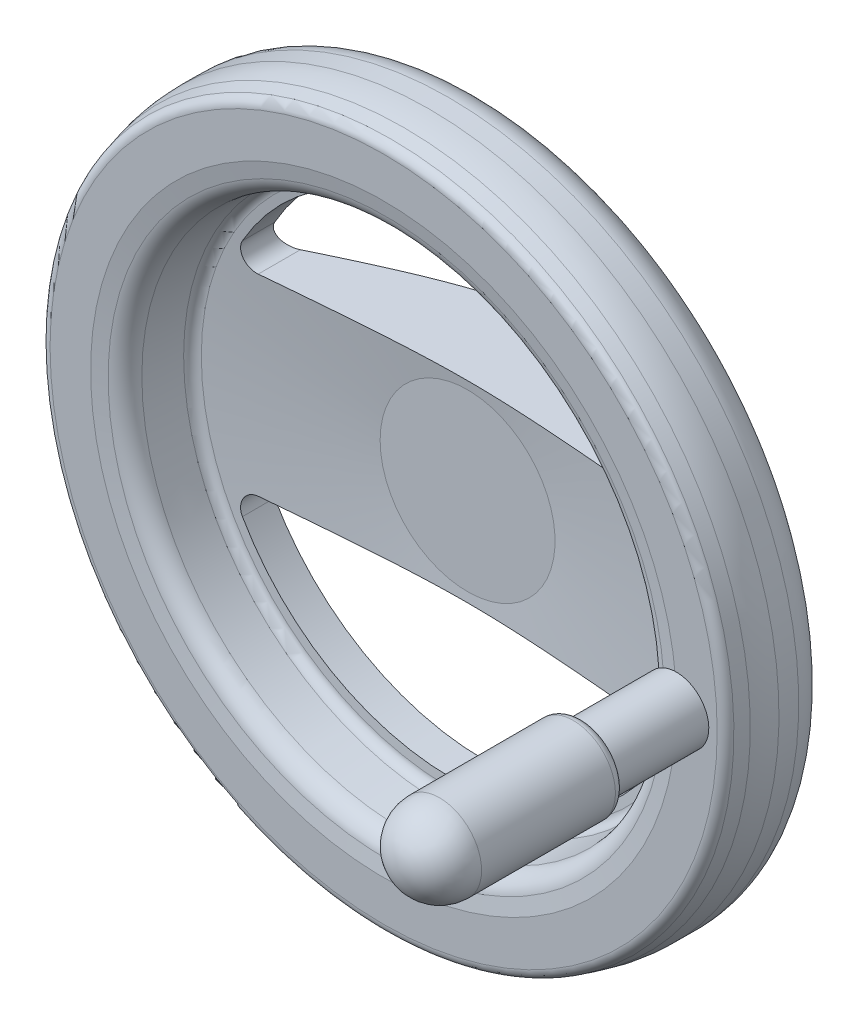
ISO-10303-21;
HEADER;
FILE_DESCRIPTION(('STEP AP214'),'2;1');
FILE_NAME('part.step','',(''),(''),'','','');
FILE_SCHEMA(('AUTOMOTIVE_DESIGN { 1 0 10303 214 1 1 1 1 }'));
ENDSEC;
DATA;
#1=APPLICATION_CONTEXT('core data for automotive mechanical design processes');
#2=APPLICATION_PROTOCOL_DEFINITION('international standard','automotive_design',2000,#1);
#3=PRODUCT_CONTEXT('',#1,'mechanical');
#4=PRODUCT('Part','Part','',(#3));
#5=PRODUCT_RELATED_PRODUCT_CATEGORY('part','',(#4));
#6=PRODUCT_DEFINITION_FORMATION('','',#4);
#7=PRODUCT_DEFINITION_CONTEXT('part definition',#1,'design');
#8=PRODUCT_DEFINITION('design','',#6,#7);
#9=PRODUCT_DEFINITION_SHAPE('','',#8);
#10=(LENGTH_UNIT() NAMED_UNIT(*) SI_UNIT(.MILLI.,.METRE.));
#11=(NAMED_UNIT(*) PLANE_ANGLE_UNIT() SI_UNIT($,.RADIAN.));
#12=(NAMED_UNIT(*) SI_UNIT($,.STERADIAN.) SOLID_ANGLE_UNIT());
#13=UNCERTAINTY_MEASURE_WITH_UNIT(LENGTH_MEASURE(1.E-05),#10,'distance_accuracy_value','');
#14=(GEOMETRIC_REPRESENTATION_CONTEXT(3) GLOBAL_UNCERTAINTY_ASSIGNED_CONTEXT((#13)) GLOBAL_UNIT_ASSIGNED_CONTEXT((#10,
#11,#12)) REPRESENTATION_CONTEXT('',''));
#15=CARTESIAN_POINT('',(0.,0.,0.));
#16=DIRECTION('',(0.,0.,1.));
#17=DIRECTION('',(1.,0.,0.));
#18=AXIS2_PLACEMENT_3D('',#15,#16,#17);
#19=CARTESIAN_POINT('',(84.,0.,49.3333333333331));
#20=DIRECTION('',(0.,0.,1.));
#21=DIRECTION('',(0.,-1.,0.));
#22=AXIS2_PLACEMENT_3D('',#19,#20,#21);
#23=CYLINDRICAL_SURFACE('',#22,3.3235);
#24=CARTESIAN_POINT('',(84.,0.,46.0904999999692));
#25=DIRECTION('',(0.,0.,1.));
#26=DIRECTION('',(0.,-1.,0.));
#27=AXIS2_PLACEMENT_3D('',#24,#25,#26);
#28=CIRCLE('',#27,3.3235);
#29=CARTESIAN_POINT('',(84.,-3.32349999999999,46.0904999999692));
#30=VERTEX_POINT('',#29);
#31=EDGE_CURVE('E736',#30,#30,#28,.F.);
#32=ORIENTED_EDGE('',*,*,#31,.F.);
#33=EDGE_LOOP('',(#32));
#34=FACE_BOUND('',#33,.T.);
#35=CARTESIAN_POINT('',(84.,0.,38.3431666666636));
#36=DIRECTION('',(0.,0.,-1.));
#37=DIRECTION('',(-1.,0.,0.));
#38=AXIS2_PLACEMENT_3D('',#35,#36,#37);
#39=CIRCLE('',#38,3.32350000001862);
#40=CARTESIAN_POINT('',(80.6764999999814,0.,38.3431666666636));
#41=VERTEX_POINT('',#40);
#42=EDGE_CURVE('E505',#41,#41,#39,.T.);
#43=ORIENTED_EDGE('',*,*,#42,.T.);
#44=EDGE_LOOP('',(#43));
#45=FACE_BOUND('',#44,.T.);
#46=ADVANCED_FACE('F14',(#34,#45),#23,.F.);
#47=CARTESIAN_POINT('',(84.,0.,37.66666666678));
#48=DIRECTION('',(0.,0.,-1.));
#49=DIRECTION('',(0.,1.,0.));
#50=AXIS2_PLACEMENT_3D('',#47,#48,#49);
#51=CONICAL_SURFACE('',#50,3.99999999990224,0.785398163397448);
#52=CARTESIAN_POINT('',(84.,0.,37.6666666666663));
#53=DIRECTION('',(0.,0.,-1.));
#54=DIRECTION('',(0.,1.,0.));
#55=AXIS2_PLACEMENT_3D('',#52,#53,#54);
#56=CIRCLE('',#55,4.00000000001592);
#57=CARTESIAN_POINT('',(84.,4.00000000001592,37.6666666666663));
#58=VERTEX_POINT('',#57);
#59=EDGE_CURVE('E465',#58,#58,#56,.T.);
#60=ORIENTED_EDGE('',*,*,#59,.T.);
#61=EDGE_LOOP('',(#60));
#62=FACE_BOUND('',#61,.T.);
#63=ORIENTED_EDGE('',*,*,#42,.F.);
#64=EDGE_LOOP('',(#63));
#65=FACE_BOUND('',#64,.T.);
#66=ADVANCED_FACE('F491',(#62,#65),#51,.F.);
#67=CARTESIAN_POINT('',(79.3333333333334,0.,37.6666666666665));
#68=DIRECTION('',(0.,0.,1.));
#69=DIRECTION('',(0.,-1.,0.));
#70=AXIS2_PLACEMENT_3D('',#67,#68,#69);
#71=PLANE('',#70);
#72=ORIENTED_EDGE('',*,*,#59,.F.);
#73=EDGE_LOOP('',(#72));
#74=FACE_BOUND('',#73,.T.);
#75=CARTESIAN_POINT('',(84.,0.,37.6666666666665));
#76=DIRECTION('',(0.,0.,1.));
#77=DIRECTION('',(0.,-1.,0.));
#78=AXIS2_PLACEMENT_3D('',#75,#76,#77);
#79=CIRCLE('',#78,5.33333333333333);
#80=CARTESIAN_POINT('',(84.,-5.33333333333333,37.6666666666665));
#81=VERTEX_POINT('',#80);
#82=EDGE_CURVE('E343',#81,#81,#79,.F.);
#83=ORIENTED_EDGE('',*,*,#82,.T.);
#84=EDGE_LOOP('',(#83));
#85=FACE_BOUND('',#84,.T.);
#86=ADVANCED_FACE('F493',(#74,#85),#71,.F.);
#87=CARTESIAN_POINT('',(84.,0.,35.3333333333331));
#88=DIRECTION('',(0.,0.,1.));
#89=DIRECTION('',(0.,-1.,0.));
#90=AXIS2_PLACEMENT_3D('',#87,#88,#89);
#91=CYLINDRICAL_SURFACE('',#90,5.33333333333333);
#92=CARTESIAN_POINT('',(84.,0.,33.));
#93=DIRECTION('',(0.,0.,1.));
#94=DIRECTION('',(0.,-1.,0.));
#95=AXIS2_PLACEMENT_3D('',#92,#93,#94);
#96=CIRCLE('',#95,5.33333333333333);
#97=CARTESIAN_POINT('',(84.,-5.33333333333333,33.));
#98=VERTEX_POINT('',#97);
#99=EDGE_CURVE('E330',#98,#98,#96,.T.);
#100=ORIENTED_EDGE('',*,*,#99,.F.);
#101=EDGE_LOOP('',(#100));
#102=FACE_BOUND('',#101,.T.);
#103=ORIENTED_EDGE('',*,*,#82,.F.);
#104=EDGE_LOOP('',(#103));
#105=FACE_BOUND('',#104,.T.);
#106=ADVANCED_FACE('F266',(#102,#105),#91,.F.);
#107=CARTESIAN_POINT('',(-81.2262227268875,0.,33.));
#108=DIRECTION('',(0.,0.,-1.));
#109=DIRECTION('',(0.,1.,0.));
#110=AXIS2_PLACEMENT_3D('',#107,#108,#109);
#111=PLANE('',#110);
#112=CARTESIAN_POINT('',(0.,0.,33.0000000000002));
#113=DIRECTION('',(0.,0.,1.));
#114=DIRECTION('',(0.,-1.,0.));
#115=AXIS2_PLACEMENT_3D('',#112,#113,#114);
#116=CIRCLE('',#115,90.6666666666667);
#117=CARTESIAN_POINT('',(0.,90.6666666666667,33.));
#118=VERTEX_POINT('',#117);
#119=CARTESIAN_POINT('',(0.,-90.6666666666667,33.));
#120=VERTEX_POINT('',#119);
#121=EDGE_CURVE('E307',#118,#120,#116,.F.);
#122=ORIENTED_EDGE('',*,*,#121,.T.);
#123=CARTESIAN_POINT('',(0.,0.,33.0000000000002));
#124=DIRECTION('',(0.,0.,1.));
#125=DIRECTION('',(-1.,0.,0.));
#126=AXIS2_PLACEMENT_3D('',#123,#124,#125);
#127=CIRCLE('',#126,90.6666666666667);
#128=CARTESIAN_POINT('',(-90.6666666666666,0.,33.));
#129=VERTEX_POINT('',#128);
#130=EDGE_CURVE('E315',#120,#129,#127,.F.);
#131=ORIENTED_EDGE('',*,*,#130,.T.);
#132=CARTESIAN_POINT('',(0.,0.,33.0000000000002));
#133=DIRECTION('',(0.,0.,1.));
#134=DIRECTION('',(0.,1.,0.));
#135=AXIS2_PLACEMENT_3D('',#132,#133,#134);
#136=CIRCLE('',#135,90.6666666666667);
#137=EDGE_CURVE('E317',#129,#118,#136,.F.);
#138=ORIENTED_EDGE('',*,*,#137,.T.);
#139=EDGE_LOOP('',(#122,#131,#138));
#140=FACE_BOUND('',#139,.T.);
#141=CARTESIAN_POINT('',(0.,0.,32.9999999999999));
#142=DIRECTION('',(0.,0.,-1.));
#143=DIRECTION('',(0.,-1.,0.));
#144=AXIS2_PLACEMENT_3D('',#141,#142,#143);
#145=CIRCLE('',#144,71.7857787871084);
#146=CARTESIAN_POINT('',(-71.7857787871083,0.,33.));
#147=VERTEX_POINT('',#146);
#148=CARTESIAN_POINT('',(0.,-71.7857787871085,33.));
#149=VERTEX_POINT('',#148);
#150=EDGE_CURVE('E326',#147,#149,#145,.F.);
#151=ORIENTED_EDGE('',*,*,#150,.T.);
#152=CARTESIAN_POINT('',(0.,0.,32.9999999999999));
#153=DIRECTION('',(0.,0.,-1.));
#154=DIRECTION('',(0.,1.,0.));
#155=AXIS2_PLACEMENT_3D('',#152,#153,#154);
#156=CIRCLE('',#155,71.7857787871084);
#157=CARTESIAN_POINT('',(0.,71.7857787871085,33.));
#158=VERTEX_POINT('',#157);
#159=EDGE_CURVE('E324',#149,#158,#156,.F.);
#160=ORIENTED_EDGE('',*,*,#159,.T.);
#161=CARTESIAN_POINT('',(0.,0.,32.9999999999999));
#162=DIRECTION('',(0.,0.,-1.));
#163=DIRECTION('',(-1.,0.,0.));
#164=AXIS2_PLACEMENT_3D('',#161,#162,#163);
#165=CIRCLE('',#164,71.7857787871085);
#166=EDGE_CURVE('E329',#158,#147,#165,.F.);
#167=ORIENTED_EDGE('',*,*,#166,.T.);
#168=EDGE_LOOP('',(#151,#160,#167));
#169=FACE_BOUND('',#168,.T.);
#170=ORIENTED_EDGE('',*,*,#99,.T.);
#171=EDGE_LOOP('',(#170));
#172=FACE_BOUND('',#171,.T.);
#173=ADVANCED_FACE('F167',(#140,#169,#172),#111,.T.);
#174=CARTESIAN_POINT('',(84.,0.,58.2));
#175=DIRECTION('',(0.,0.,-1.));
#176=DIRECTION('',(0.,1.,0.));
#177=AXIS2_PLACEMENT_3D('',#174,#175,#176);
#178=TOROIDAL_SURFACE('',#177,5.2,2.8);
#179=CARTESIAN_POINT('',(84.,0.,58.2));
#180=DIRECTION('',(0.,0.,-1.));
#181=DIRECTION('',(0.,1.,0.));
#182=AXIS2_PLACEMENT_3D('',#179,#180,#181);
#183=CIRCLE('',#182,8.);
#184=CARTESIAN_POINT('',(76.0713194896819,1.06584490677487,58.2));
#185=VERTEX_POINT('',#184);
#186=CARTESIAN_POINT('',(76.0713194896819,-1.06584490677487,58.2));
#187=VERTEX_POINT('',#186);
#188=EDGE_CURVE('E124',#185,#187,#183,.F.);
#189=ORIENTED_EDGE('',*,*,#188,.T.);
#190=CARTESIAN_POINT('',(76.0713194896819,-1.06584490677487,58.2));
#191=CARTESIAN_POINT('',(76.0868536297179,-1.18138388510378,58.2217227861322));
#192=CARTESIAN_POINT('',(76.1050719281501,-1.29590572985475,58.2468941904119));
#193=CARTESIAN_POINT('',(76.1471317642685,-1.52229500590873,58.3035284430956));
#194=CARTESIAN_POINT('',(76.1709716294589,-1.63416321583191,58.3349894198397));
#195=CARTESIAN_POINT('',(76.2244630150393,-1.85438390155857,58.4035140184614));
#196=CARTESIAN_POINT('',(76.2540979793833,-1.96274539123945,58.4405616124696));
#197=CARTESIAN_POINT('',(76.3194727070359,-2.17578649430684,58.5195533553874));
#198=CARTESIAN_POINT('',(76.3552130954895,-2.28046572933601,58.5614980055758));
#199=CARTESIAN_POINT('',(76.4386027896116,-2.50048664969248,58.6557237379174));
#200=CARTESIAN_POINT('',(76.4872256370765,-2.61519585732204,58.7086237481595));
#201=CARTESIAN_POINT('',(76.5929185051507,-2.83877856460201,58.8181838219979));
#202=CARTESIAN_POINT('',(76.6499892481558,-2.9476515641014,58.8748442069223));
#203=CARTESIAN_POINT('',(76.7725887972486,-3.1592844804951,58.9903186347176));
#204=CARTESIAN_POINT('',(76.8381161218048,-3.2620454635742,59.04913229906));
#205=CARTESIAN_POINT('',(76.9774681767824,-3.46143491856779,59.1672980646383));
#206=CARTESIAN_POINT('',(77.0512929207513,-3.55806338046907,59.2266501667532));
#207=CARTESIAN_POINT('',(77.2128884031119,-3.7526017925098,59.3488528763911));
#208=CARTESIAN_POINT('',(77.3012957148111,-3.85003517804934,59.4116200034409));
#209=CARTESIAN_POINT('',(77.486629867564,-4.03850686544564,59.5340977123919));
#210=CARTESIAN_POINT('',(77.5835574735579,-4.12954459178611,59.5938080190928));
#211=CARTESIAN_POINT('',(77.7851397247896,-4.30612899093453,59.7086054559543));
#212=CARTESIAN_POINT('',(77.8898053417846,-4.39166753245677,59.7636857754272));
#213=CARTESIAN_POINT('',(78.1056060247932,-4.55814894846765,59.8677194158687));
#214=CARTESIAN_POINT('',(78.2167403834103,-4.63909232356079,59.9166734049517));
#215=CARTESIAN_POINT('',(78.4095389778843,-4.77348685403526,59.9935237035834));
#216=CARTESIAN_POINT('',(78.4898669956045,-4.82780118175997,60.0232917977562));
#217=CARTESIAN_POINT('',(78.6525706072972,-4.93527962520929,60.0790349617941));
#218=CARTESIAN_POINT('',(78.73494596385,-4.98844387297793,60.1050104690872));
#219=CARTESIAN_POINT('',(78.9010459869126,-5.09394609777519,60.1528692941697));
#220=CARTESIAN_POINT('',(78.9847661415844,-5.14628599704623,60.174764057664));
#221=CARTESIAN_POINT('',(79.1533400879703,-5.25072670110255,60.214405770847));
#222=CARTESIAN_POINT('',(79.2381939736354,-5.30282748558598,60.2321523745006));
#223=CARTESIAN_POINT('',(79.3233859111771,-5.35502083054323,60.2477496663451));
#224=B_SPLINE_CURVE_WITH_KNOTS('',3,(#190,#191,#192,#193,#194,#195,#196,#197,#198,#199,#200,
#201,#202,#203,#204,#205,#206,#207,#208,#209,#210,#211,#212,#213,#214,#215,#216,#217,#218,#219,
#220,#221,#222,#223),.UNSPECIFIED.,.F.,.F.,(4,2,2,2,2,2,2,2,2,2,2,2,2,2,2,2,4),(0.,
0.355660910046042,0.711216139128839,1.06577004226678,1.42036027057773,1.82596126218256,
2.23159695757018,2.63716168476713,3.04272707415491,3.47959037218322,3.91649293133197,
4.35402731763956,4.79151394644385,5.09572335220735,5.39989764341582,5.70320550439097,
6.00653865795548),.UNSPECIFIED.);
#225=CARTESIAN_POINT('',(79.3233859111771,-5.35502083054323,60.247749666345));
#226=VERTEX_POINT('',#225);
#227=EDGE_CURVE('E136',#187,#226,#224,.T.);
#228=ORIENTED_EDGE('',*,*,#227,.T.);
#229=CARTESIAN_POINT('',(79.3233859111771,-5.35502083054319,60.247749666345));
#230=CARTESIAN_POINT('',(79.571832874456,-5.50715469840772,60.2932680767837));
#231=CARTESIAN_POINT('',(79.8322912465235,-5.63931489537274,60.3407162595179));
#232=CARTESIAN_POINT('',(80.2379051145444,-5.80314636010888,60.4141204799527));
#233=CARTESIAN_POINT('',(80.376377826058,-5.85219009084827,60.4391000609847));
#234=CARTESIAN_POINT('',(80.6570320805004,-5.93746047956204,60.4895528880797));
#235=CARTESIAN_POINT('',(80.7992111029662,-5.97369561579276,60.515025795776));
#236=CARTESIAN_POINT('',(81.1473343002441,-6.0447638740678,60.5771677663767));
#237=CARTESIAN_POINT('',(81.3547949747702,-6.0725112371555,60.6140119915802));
#238=CARTESIAN_POINT('',(81.6668674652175,-6.09006776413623,60.6691167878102));
#239=CARTESIAN_POINT('',(81.7708858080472,-6.09192396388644,60.6874314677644));
#240=CARTESIAN_POINT('',(81.9787154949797,-6.08698116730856,60.7239118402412));
#241=CARTESIAN_POINT('',(82.0825269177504,-6.08018659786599,60.7420776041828));
#242=CARTESIAN_POINT('',(82.3026800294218,-6.05553879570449,60.7804710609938));
#243=CARTESIAN_POINT('',(82.4188927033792,-6.03636049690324,60.8006591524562));
#244=CARTESIAN_POINT('',(82.5908647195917,-5.99699381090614,60.8303982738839));
#245=CARTESIAN_POINT('',(82.6478071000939,-5.98210158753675,60.8402224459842));
#246=CARTESIAN_POINT('',(82.7605531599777,-5.94841960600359,60.8596238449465));
#247=CARTESIAN_POINT('',(82.8163572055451,-5.92963112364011,60.8692011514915));
#248=CARTESIAN_POINT('',(82.9441822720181,-5.88091883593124,60.8910722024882));
#249=CARTESIAN_POINT('',(83.0156275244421,-5.8493580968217,60.9032455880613));
#250=CARTESIAN_POINT('',(83.1192679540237,-5.79517958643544,60.920808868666));
#251=CARTESIAN_POINT('',(83.1532094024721,-5.77599277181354,60.926544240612));
#252=CARTESIAN_POINT('',(83.219555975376,-5.73506109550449,60.9377168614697));
#253=CARTESIAN_POINT('',(83.2519619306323,-5.71331763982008,60.9431542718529));
#254=CARTESIAN_POINT('',(83.3193473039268,-5.66353660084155,60.9544101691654));
#255=CARTESIAN_POINT('',(83.354005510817,-5.63504362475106,60.9601673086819));
#256=CARTESIAN_POINT('',(83.4194169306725,-5.57368362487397,60.970949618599));
#257=CARTESIAN_POINT('',(83.4501725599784,-5.54081933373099,60.9759752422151));
#258=CARTESIAN_POINT('',(83.4989639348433,-5.47891064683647,60.9838414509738));
#259=CARTESIAN_POINT('',(83.5182690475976,-5.45090772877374,60.9869156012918));
#260=CARTESIAN_POINT('',(83.5522544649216,-5.39222092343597,60.9922253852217));
#261=CARTESIAN_POINT('',(83.566953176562,-5.36154834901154,60.9944643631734));
#262=CARTESIAN_POINT('',(83.5871906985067,-5.3066770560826,60.9974098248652));
#263=CARTESIAN_POINT('',(83.5941363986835,-5.28301291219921,60.9983682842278));
#264=CARTESIAN_POINT('',(83.6045689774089,-5.23473358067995,60.9996697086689));
#265=CARTESIAN_POINT('',(83.6080288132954,-5.21011247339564,61.0000078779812));
#266=CARTESIAN_POINT('',(83.6095214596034,-5.18531836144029,61.));
#267=B_SPLINE_CURVE_WITH_KNOTS('',3,(#229,#230,#231,#232,#233,#234,#235,#236,#237,#238,#239,
#240,#241,#242,#243,#244,#245,#246,#247,#248,#249,#250,#251,#252,#253,#254,#255,#256,#257,#258,
#259,#260,#261,#262,#263,#264,#265,#266),.UNSPECIFIED.,.F.,.F.,(4,2,2,2,2,2,2,2,2,2,2,2,2,2,2,2,
2,2,4),(0.,0.883426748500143,1.32993623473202,1.77614961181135,2.41123912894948,
2.72785932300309,3.04431755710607,3.40199261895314,3.5808913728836,3.75973164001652,
3.99626392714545,4.1144019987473,4.23247540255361,4.36789285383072,4.50322604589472,
4.60535117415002,4.70706284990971,4.78085013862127,4.85520554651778),.UNSPECIFIED.);
#268=CARTESIAN_POINT('',(83.6095214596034,-5.18531836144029,61.));
#269=VERTEX_POINT('',#268);
#270=EDGE_CURVE('E1251',#226,#269,#267,.T.);
#271=ORIENTED_EDGE('',*,*,#270,.T.);
#272=CARTESIAN_POINT('',(84.,0.,61.));
#273=DIRECTION('',(0.,0.,-1.));
#274=DIRECTION('',(-0.0750920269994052,-0.997176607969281,0.));
#275=AXIS2_PLACEMENT_3D('',#272,#273,#274);
#276=CIRCLE('',#275,5.2);
#277=CARTESIAN_POINT('',(83.6095214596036,5.18531836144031,61.));
#278=VERTEX_POINT('',#277);
#279=EDGE_CURVE('E31',#269,#278,#276,.T.);
#280=ORIENTED_EDGE('',*,*,#279,.T.);
#281=CARTESIAN_POINT('',(83.6095214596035,5.18531836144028,61.));
#282=CARTESIAN_POINT('',(83.608575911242,5.20066067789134,61.0000010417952));
#283=CARTESIAN_POINT('',(83.6068978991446,5.21594840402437,60.9998733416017));
#284=CARTESIAN_POINT('',(83.6021371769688,5.24627885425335,60.999369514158));
#285=CARTESIAN_POINT('',(83.5990563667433,5.26132188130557,60.998993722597));
#286=CARTESIAN_POINT('',(83.5878937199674,5.30554355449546,60.9975205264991));
#287=CARTESIAN_POINT('',(83.5778627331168,5.33423211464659,60.9960767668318));
#288=CARTESIAN_POINT('',(83.5504660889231,5.39637788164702,60.9919575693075));
#289=CARTESIAN_POINT('',(83.5319057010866,5.42928196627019,60.9890670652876));
#290=CARTESIAN_POINT('',(83.4898042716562,5.4917861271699,60.9823783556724));
#291=CARTESIAN_POINT('',(83.4662359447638,5.52136668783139,60.9785751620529));
#292=CARTESIAN_POINT('',(83.4000445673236,5.59444588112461,60.9677846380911));
#293=CARTESIAN_POINT('',(83.3546219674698,5.63530477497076,60.9602782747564));
#294=CARTESIAN_POINT('',(83.258484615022,5.70983739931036,60.9442586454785));
#295=CARTESIAN_POINT('',(83.2077606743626,5.74349833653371,60.9357436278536));
#296=CARTESIAN_POINT('',(83.1071784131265,5.80237166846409,60.9187699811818));
#297=CARTESIAN_POINT('',(83.0575772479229,5.82804526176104,60.9103616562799));
#298=CARTESIAN_POINT('',(82.9563975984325,5.8750387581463,60.8931478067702));
#299=CARTESIAN_POINT('',(82.9048175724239,5.89635518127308,60.88434197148));
#300=CARTESIAN_POINT('',(82.8002162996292,5.93515622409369,60.8664320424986));
#301=CARTESIAN_POINT('',(82.7471931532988,5.95263548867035,60.8573275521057));
#302=CARTESIAN_POINT('',(82.6401545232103,5.98411412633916,60.8389022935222));
#303=CARTESIAN_POINT('',(82.5861387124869,5.99811232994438,60.8295814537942));
#304=CARTESIAN_POINT('',(82.438896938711,6.03171680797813,60.8041176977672));
#305=CARTESIAN_POINT('',(82.3449927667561,6.04827436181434,60.7878180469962));
#306=CARTESIAN_POINT('',(82.1561552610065,6.07318325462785,60.7549337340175));
#307=CARTESIAN_POINT('',(82.0612213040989,6.08152930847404,60.7383488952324));
#308=CARTESIAN_POINT('',(81.7757473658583,6.09541121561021,60.6883314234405));
#309=CARTESIAN_POINT('',(81.5846240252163,6.08977247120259,60.6546511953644));
#310=CARTESIAN_POINT('',(81.2636474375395,6.05851283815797,60.5978013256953));
#311=CARTESIAN_POINT('',(81.133047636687,6.03957883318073,60.5745883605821));
#312=CARTESIAN_POINT('',(80.873945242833,5.99036059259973,60.5283844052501));
#313=CARTESIAN_POINT('',(80.7454432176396,5.96007333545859,60.5053934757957));
#314=CARTESIAN_POINT('',(80.3643781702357,5.85339130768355,60.437003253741));
#315=CARTESIAN_POINT('',(80.1159524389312,5.76114331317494,60.3921326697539));
#316=CARTESIAN_POINT('',(79.7810825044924,5.60686992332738,60.3313138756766));
#317=CARTESIAN_POINT('',(79.6873690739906,5.56020711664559,60.3142546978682));
#318=CARTESIAN_POINT('',(79.5030770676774,5.4615573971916,60.2806351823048));
#319=CARTESIAN_POINT('',(79.4124896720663,5.40958744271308,60.2640734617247));
#320=CARTESIAN_POINT('',(79.3233859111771,5.35502083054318,60.247749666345));
#321=B_SPLINE_CURVE_WITH_KNOTS('',3,(#281,#282,#283,#284,#285,#286,#287,#288,#289,#290,#291,
#292,#293,#294,#295,#296,#297,#298,#299,#300,#301,#302,#303,#304,#305,#306,#307,#308,#309,#310,
#311,#312,#313,#314,#315,#316,#317,#318,#319,#320),.UNSPECIFIED.,.F.,.F.,(4,2,2,2,2,2,2,2,2,2,2,
2,2,2,2,2,2,2,2,4),(0.,0.0460797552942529,0.0920972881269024,0.182897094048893,
0.295937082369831,0.409609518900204,0.5932473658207,0.777208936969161,0.946408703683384,
1.11574308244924,1.28531230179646,1.45493841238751,1.7446889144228,2.03462578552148,
2.61477212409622,3.01629598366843,3.41792678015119,4.22026872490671,4.53835697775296,
4.85545886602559),.UNSPECIFIED.);
#322=CARTESIAN_POINT('',(79.3233859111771,5.35502083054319,60.2477496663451));
#323=VERTEX_POINT('',#322);
#324=EDGE_CURVE('E144',#278,#323,#321,.T.);
#325=ORIENTED_EDGE('',*,*,#324,.T.);
#326=CARTESIAN_POINT('',(79.3233859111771,5.35502083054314,60.2477496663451));
#327=CARTESIAN_POINT('',(79.2123424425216,5.28697543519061,60.2274368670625));
#328=CARTESIAN_POINT('',(79.1018669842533,5.21910337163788,60.2034450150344));
#329=CARTESIAN_POINT('',(78.8829342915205,5.08264407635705,60.1484560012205));
#330=CARTESIAN_POINT('',(78.7744795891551,5.01405609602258,60.1174506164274));
#331=CARTESIAN_POINT('',(78.5606905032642,4.87522861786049,60.048822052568));
#332=CARTESIAN_POINT('',(78.4553575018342,4.80498841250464,60.0111959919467));
#333=CARTESIAN_POINT('',(78.2487269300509,4.66174341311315,59.929902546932));
#334=CARTESIAN_POINT('',(78.1474355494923,4.58873468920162,59.8862263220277));
#335=CARTESIAN_POINT('',(77.9500788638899,4.43915167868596,59.7937178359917));
#336=CARTESIAN_POINT('',(77.8540101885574,4.36257975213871,59.7448889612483));
#337=CARTESIAN_POINT('',(77.6679302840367,4.20504310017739,59.6430727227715));
#338=CARTESIAN_POINT('',(77.5779163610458,4.12408035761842,59.5900872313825));
#339=CARTESIAN_POINT('',(77.4251804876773,3.97689098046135,59.4940355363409));
#340=CARTESIAN_POINT('',(77.3610456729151,3.91171847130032,59.4515939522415));
#341=CARTESIAN_POINT('',(77.2369665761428,3.77820795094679,59.365542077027));
#342=CARTESIAN_POINT('',(77.1770227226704,3.70986961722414,59.321931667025));
#343=CARTESIAN_POINT('',(77.0615506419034,3.56988464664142,59.2341685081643));
#344=CARTESIAN_POINT('',(77.0060224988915,3.49823794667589,59.1900157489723));
#345=CARTESIAN_POINT('',(76.899849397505,3.35198166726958,59.1020779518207));
#346=CARTESIAN_POINT('',(76.849177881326,3.27739177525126,59.0582922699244));
#347=CARTESIAN_POINT('',(76.7524502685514,3.12484694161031,58.971488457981));
#348=CARTESIAN_POINT('',(76.706394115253,3.04689204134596,58.9284703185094));
#349=CARTESIAN_POINT('',(76.6189341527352,2.8876696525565,58.843861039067));
#350=CARTESIAN_POINT('',(76.5775301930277,2.80640227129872,58.8022698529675));
#351=CARTESIAN_POINT('',(76.4992910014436,2.64053501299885,58.7210915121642));
#352=CARTESIAN_POINT('',(76.4624631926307,2.55593000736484,58.6815076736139));
#353=CARTESIAN_POINT('',(76.3933834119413,2.38368452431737,58.6050291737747));
#354=CARTESIAN_POINT('',(76.3611316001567,2.29604394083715,58.5681346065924));
#355=CARTESIAN_POINT('',(76.3010962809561,2.11796800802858,58.4976060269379));
#356=CARTESIAN_POINT('',(76.2733125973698,2.02753276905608,58.4639718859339));
#357=CARTESIAN_POINT('',(76.2216344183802,1.84258138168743,58.3999272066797));
#358=CARTESIAN_POINT('',(76.1978144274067,1.74802191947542,58.3695815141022));
#359=CARTESIAN_POINT('',(76.1544802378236,1.55662262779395,58.3132462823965));
#360=CARTESIAN_POINT('',(76.1349669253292,1.45978233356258,58.2872576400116));
#361=CARTESIAN_POINT('',(76.1000762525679,1.26416089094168,58.2399942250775));
#362=CARTESIAN_POINT('',(76.0847014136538,1.16537859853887,58.2187223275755));
#363=CARTESIAN_POINT('',(76.0713194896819,1.06584490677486,58.2));
#364=B_SPLINE_CURVE_WITH_KNOTS('',3,(#326,#327,#328,#329,#330,#331,#332,#333,#334,#335,#336,
#337,#338,#339,#340,#341,#342,#343,#344,#345,#346,#347,#348,#349,#350,#351,#352,#353,#354,#355,
#356,#357,#358,#359,#360,#361,#362,#363),.UNSPECIFIED.,.F.,.F.,(4,2,2,2,2,2,2,2,2,2,2,2,2,2,2,2,
2,2,4),(0.,0.395374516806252,0.791215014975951,1.18722822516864,1.58382631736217,
1.98016536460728,2.37632689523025,2.67861512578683,2.98093422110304,3.2832590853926,
3.58382309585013,3.88438341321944,4.18493400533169,4.48596593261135,4.7870083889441,
5.08803897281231,5.39420940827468,5.70044278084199,6.00686230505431),.UNSPECIFIED.);
#365=EDGE_CURVE('E142',#323,#185,#364,.T.);
#366=ORIENTED_EDGE('',*,*,#365,.T.);
#367=EDGE_LOOP('',(#189,#228,#271,#280,#325,#366));
#368=FACE_BOUND('',#367,.T.);
#369=ADVANCED_FACE('F141',(#368),#178,.T.);
#370=CARTESIAN_POINT('',(84.,0.,47.9333333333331));
#371=DIRECTION('',(0.,0.,1.));
#372=DIRECTION('',(0.,-1.,0.));
#373=AXIS2_PLACEMENT_3D('',#370,#371,#372);
#374=CYLINDRICAL_SURFACE('',#373,8.);
#375=CARTESIAN_POINT('',(76.0713194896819,-1.06584490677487,58.2));
#376=CARTESIAN_POINT('',(76.0595026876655,-0.977971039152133,58.1834424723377));
#377=CARTESIAN_POINT('',(76.0491073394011,-0.88954871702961,58.1686967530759));
#378=CARTESIAN_POINT('',(76.0312310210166,-0.711817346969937,58.1431355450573));
#379=CARTESIAN_POINT('',(76.0237510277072,-0.622508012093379,58.1323213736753));
#380=CARTESIAN_POINT('',(76.0118651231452,-0.444473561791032,58.1150578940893));
#381=CARTESIAN_POINT('',(76.007419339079,-0.35575666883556,58.108552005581));
#382=CARTESIAN_POINT('',(76.0014870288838,-0.178026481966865,58.0998567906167));
#383=CARTESIAN_POINT('',(76.,-0.0890132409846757,58.0976667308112));
#384=CARTESIAN_POINT('',(76.,0.0890132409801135,58.0976667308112));
#385=CARTESIAN_POINT('',(76.0014870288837,0.178026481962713,58.0998567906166));
#386=CARTESIAN_POINT('',(76.0074193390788,0.355756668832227,58.1085520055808));
#387=CARTESIAN_POINT('',(76.011865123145,0.444473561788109,58.115057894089));
#388=CARTESIAN_POINT('',(76.023751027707,0.622508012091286,58.132321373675));
#389=CARTESIAN_POINT('',(76.0312310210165,0.711817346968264,58.1431355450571));
#390=CARTESIAN_POINT('',(76.049107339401,0.889548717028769,58.1686967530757));
#391=CARTESIAN_POINT('',(76.0595026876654,0.977971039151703,58.1834424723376));
#392=CARTESIAN_POINT('',(76.0713194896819,1.06584490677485,58.2));
#393=B_SPLINE_CURVE_WITH_KNOTS('',3,(#375,#376,#377,#378,#379,#380,#381,#382,#383,#384,#385,
#386,#387,#388,#389,#390,#391,#392),.UNSPECIFIED.,.F.,.F.,(4,2,2,2,2,2,2,2,4),(0.,
0.270585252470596,0.541261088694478,0.808307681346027,1.07530889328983,1.34231010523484,
1.60935669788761,1.88003253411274,2.15061778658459),.UNSPECIFIED.);
#394=EDGE_CURVE('E126',#187,#185,#393,.T.);
#395=ORIENTED_EDGE('',*,*,#394,.F.);
#396=ORIENTED_EDGE('',*,*,#188,.F.);
#397=EDGE_LOOP('',(#395,#396));
#398=FACE_BOUND('',#397,.T.);
#399=ADVANCED_FACE('F128',(#398),#374,.T.);
#400=CARTESIAN_POINT('',(0.,0.,54.7328262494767));
#401=DIRECTION('',(0.,0.,-1.));
#402=DIRECTION('',(0.,1.,0.));
#403=AXIS2_PLACEMENT_3D('',#400,#401,#402);
#404=TOROIDAL_SURFACE('',#403,80.4763655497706,5.6);
#405=CARTESIAN_POINT('',(0.,0.,55.2208984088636));
#406=DIRECTION('',(0.,0.,1.));
#407=DIRECTION('',(-1.,0.,0.));
#408=AXIS2_PLACEMENT_3D('',#405,#406,#407);
#409=CIRCLE('',#408,74.8976752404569);
#410=CARTESIAN_POINT('',(-74.8976752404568,0.,55.2208984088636));
#411=VERTEX_POINT('',#410);
#412=EDGE_CURVE('E608',#411,#411,#409,.F.);
#413=ORIENTED_EDGE('',*,*,#412,.T.);
#414=EDGE_LOOP('',(#413));
#415=FACE_BOUND('',#414,.T.);
#416=ORIENTED_EDGE('',*,*,#365,.F.);
#417=CARTESIAN_POINT('',(0.,0.,60.247749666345));
#418=DIRECTION('',(0.,0.,1.));
#419=DIRECTION('',(-1.,0.,0.));
#420=AXIS2_PLACEMENT_3D('',#417,#418,#419);
#421=CIRCLE('',#420,79.5039357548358);
#422=EDGE_CURVE('E132',#323,#226,#421,.T.);
#423=ORIENTED_EDGE('',*,*,#422,.T.);
#424=ORIENTED_EDGE('',*,*,#227,.F.);
#425=ORIENTED_EDGE('',*,*,#394,.T.);
#426=EDGE_LOOP('',(#416,#423,#424,#425));
#427=FACE_BOUND('',#426,.T.);
#428=ADVANCED_FACE('F137',(#415,#427),#404,.T.);
#429=CARTESIAN_POINT('',(-89.5603923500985,0.,61.));
#430=DIRECTION('',(0.,0.,1.));
#431=DIRECTION('',(-1.,0.,0.));
#432=AXIS2_PLACEMENT_3D('',#429,#430,#431);
#433=PLANE('',#432);
#434=CARTESIAN_POINT('',(0.,0.,61.));
#435=DIRECTION('',(0.,0.,1.));
#436=DIRECTION('',(-1.,0.,0.));
#437=AXIS2_PLACEMENT_3D('',#434,#435,#436);
#438=CIRCLE('',#437,83.7701593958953);
#439=CARTESIAN_POINT('',(83.4839922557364,-6.9182831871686,61.));
#440=VERTEX_POINT('',#439);
#441=CARTESIAN_POINT('',(83.4839922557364,6.91828318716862,61.));
#442=VERTEX_POINT('',#441);
#443=EDGE_CURVE('E559',#440,#442,#438,.F.);
#444=ORIENTED_EDGE('',*,*,#443,.T.);
#445=CARTESIAN_POINT('',(84.,0.,61.));
#446=DIRECTION('',(0.,0.,1.));
#447=DIRECTION('',(0.,-1.,0.));
#448=AXIS2_PLACEMENT_3D('',#445,#446,#447);
#449=CIRCLE('',#448,6.9375);
#450=EDGE_CURVE('E1226',#440,#442,#449,.T.);
#451=ORIENTED_EDGE('',*,*,#450,.F.);
#452=EDGE_LOOP('',(#444,#451));
#453=FACE_BOUND('',#452,.T.);
#454=CARTESIAN_POINT('',(0.,0.,61.));
#455=DIRECTION('',(0.,0.,-1.));
#456=DIRECTION('',(0.,-1.,0.));
#457=AXIS2_PLACEMENT_3D('',#454,#455,#456);
#458=CIRCLE('',#457,95.3506253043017);
#459=CARTESIAN_POINT('',(0.,-95.3506253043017,61.));
#460=VERTEX_POINT('',#459);
#461=CARTESIAN_POINT('',(-95.3506253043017,0.,61.));
#462=VERTEX_POINT('',#461);
#463=EDGE_CURVE('E545',#460,#462,#458,.T.);
#464=ORIENTED_EDGE('',*,*,#463,.F.);
#465=CARTESIAN_POINT('',(0.,0.,61.));
#466=DIRECTION('',(0.,0.,-1.));
#467=DIRECTION('',(0.,1.,0.));
#468=AXIS2_PLACEMENT_3D('',#465,#466,#467);
#469=CIRCLE('',#468,95.3506253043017);
#470=CARTESIAN_POINT('',(0.,95.3506253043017,61.));
#471=VERTEX_POINT('',#470);
#472=EDGE_CURVE('E547',#471,#460,#469,.T.);
#473=ORIENTED_EDGE('',*,*,#472,.F.);
#474=CARTESIAN_POINT('',(0.,0.,61.));
#475=DIRECTION('',(0.,0.,-1.));
#476=DIRECTION('',(-1.,0.,0.));
#477=AXIS2_PLACEMENT_3D('',#474,#475,#476);
#478=CIRCLE('',#477,95.3506253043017);
#479=EDGE_CURVE('E546',#462,#471,#478,.T.);
#480=ORIENTED_EDGE('',*,*,#479,.F.);
#481=EDGE_LOOP('',(#464,#473,#480));
#482=FACE_BOUND('',#481,.T.);
#483=ADVANCED_FACE('F199',(#453,#482),#433,.T.);
#484=CARTESIAN_POINT('',(0.,0.,61.));
#485=DIRECTION('',(0.,0.,1.));
#486=DIRECTION('',(-1.,0.,0.));
#487=AXIS2_PLACEMENT_3D('',#484,#485,#486);
#488=CONICAL_SURFACE('',#487,83.7701593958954,1.39626340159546);
#489=ORIENTED_EDGE('',*,*,#422,.F.);
#490=ORIENTED_EDGE('',*,*,#324,.F.);
#491=CARTESIAN_POINT('',(0.,1.10186783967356E-12,61.));
#492=DIRECTION('',(0.,0.,-1.));
#493=DIRECTION('',(0.,1.,0.));
#494=AXIS2_PLACEMENT_3D('',#491,#492,#493);
#495=CIRCLE('',#494,83.7701593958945);
#496=EDGE_CURVE('E738',#442,#278,#495,.T.);
#497=ORIENTED_EDGE('',*,*,#496,.F.);
#498=ORIENTED_EDGE('',*,*,#443,.F.);
#499=EDGE_CURVE('E1235',#269,#440,#495,.T.);
#500=ORIENTED_EDGE('',*,*,#499,.F.);
#501=ORIENTED_EDGE('',*,*,#270,.F.);
#502=EDGE_LOOP('',(#489,#490,#497,#498,#500,#501));
#503=FACE_BOUND('',#502,.T.);
#504=ADVANCED_FACE('F170',(#503),#488,.F.);
#505=CARTESIAN_POINT('',(0.,0.,58.2));
#506=DIRECTION('',(0.,0.,-1.));
#507=DIRECTION('',(0.,1.,0.));
#508=AXIS2_PLACEMENT_3D('',#505,#506,#507);
#509=TOROIDAL_SURFACE('',#508,95.3506253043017,2.8);
#510=CARTESIAN_POINT('',(0.,0.,58.9246933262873));
#511=DIRECTION('',(0.,0.,-1.));
#512=DIRECTION('',(-1.,0.,0.));
#513=AXIS2_PLACEMENT_3D('',#510,#511,#512);
#514=CIRCLE('',#513,98.0552176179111);
#515=CARTESIAN_POINT('',(-98.055217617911,0.,58.9246933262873));
#516=VERTEX_POINT('',#515);
#517=EDGE_CURVE('E508',#516,#516,#514,.T.);
#518=ORIENTED_EDGE('',*,*,#517,.F.);
#519=EDGE_LOOP('',(#518));
#520=FACE_BOUND('',#519,.T.);
#521=ORIENTED_EDGE('',*,*,#463,.T.);
#522=ORIENTED_EDGE('',*,*,#479,.T.);
#523=ORIENTED_EDGE('',*,*,#472,.T.);
#524=EDGE_LOOP('',(#521,#522,#523));
#525=FACE_BOUND('',#524,.T.);
#526=ADVANCED_FACE('F519',(#520,#525),#509,.T.);
#527=CARTESIAN_POINT('',(0.,0.,55.2273299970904));
#528=DIRECTION('',(0.,0.,-1.));
#529=DIRECTION('',(1.,0.,0.));
#530=AXIS2_PLACEMENT_3D('',#527,#528,#529);
#531=CONICAL_SURFACE('',#530,99.0459231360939,0.26179938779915);
#532=CARTESIAN_POINT('',(0.,0.,55.2273299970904));
#533=DIRECTION('',(0.,0.,-1.));
#534=DIRECTION('',(0.,1.,0.));
#535=AXIS2_PLACEMENT_3D('',#532,#533,#534);
#536=CIRCLE('',#535,99.0459231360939);
#537=CARTESIAN_POINT('',(0.,99.0459231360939,55.2273299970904));
#538=VERTEX_POINT('',#537);
#539=EDGE_CURVE('E463',#538,#538,#536,.T.);
#540=ORIENTED_EDGE('',*,*,#539,.F.);
#541=EDGE_LOOP('',(#540));
#542=FACE_BOUND('',#541,.T.);
#543=ORIENTED_EDGE('',*,*,#517,.T.);
#544=EDGE_LOOP('',(#543));
#545=FACE_BOUND('',#544,.T.);
#546=ADVANCED_FACE('F435',(#542,#545),#531,.T.);
#547=CARTESIAN_POINT('',(0.,0.,55.2208984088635));
#548=DIRECTION('',(0.,0.,1.));
#549=DIRECTION('',(-1.,0.,0.));
#550=AXIS2_PLACEMENT_3D('',#547,#548,#549);
#551=CONICAL_SURFACE('',#550,74.8976752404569,0.0872664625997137);
#552=CARTESIAN_POINT('',(0.,0.,44.2335055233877));
#553=DIRECTION('',(0.,0.,-1.));
#554=DIRECTION('',(0.,1.,0.));
#555=AXIS2_PLACEMENT_3D('',#552,#553,#554);
#556=CIRCLE('',#555,73.9364029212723);
#557=CARTESIAN_POINT('',(0.,73.9364029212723,44.2335055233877));
#558=VERTEX_POINT('',#557);
#559=EDGE_CURVE('E552',#558,#558,#556,.T.);
#560=ORIENTED_EDGE('',*,*,#559,.T.);
#561=EDGE_LOOP('',(#560));
#562=FACE_BOUND('',#561,.T.);
#563=ORIENTED_EDGE('',*,*,#412,.F.);
#564=EDGE_LOOP('',(#563));
#565=FACE_BOUND('',#564,.T.);
#566=ADVANCED_FACE('F578',(#562,#565),#551,.F.);
#567=CARTESIAN_POINT('',(0.,0.,47.9803967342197));
#568=DIRECTION('',(0.,0.,-1.));
#569=DIRECTION('',(0.,1.,0.));
#570=AXIS2_PLACEMENT_3D('',#567,#568,#569);
#571=TOROIDAL_SURFACE('',#570,72.,27.9999999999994);
#572=ORIENTED_EDGE('',*,*,#539,.T.);
#573=EDGE_LOOP('',(#572));
#574=FACE_BOUND('',#573,.T.);
#575=CARTESIAN_POINT('',(0.,0.,47.9803967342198));
#576=DIRECTION('',(0.,0.,1.));
#577=DIRECTION('',(-1.,0.,0.));
#578=AXIS2_PLACEMENT_3D('',#575,#576,#577);
#579=CIRCLE('',#578,100.);
#580=CARTESIAN_POINT('',(-99.9999999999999,0.,47.9803967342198));
#581=VERTEX_POINT('',#580);
#582=EDGE_CURVE('E346',#581,#581,#579,.F.);
#583=ORIENTED_EDGE('',*,*,#582,.F.);
#584=EDGE_LOOP('',(#583));
#585=FACE_BOUND('',#584,.T.);
#586=ADVANCED_FACE('F598',(#574,#585),#571,.T.);
#587=CARTESIAN_POINT('',(0.,0.,44.4775416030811));
#588=DIRECTION('',(0.,0.,-1.));
#589=DIRECTION('',(0.,1.,0.));
#590=AXIS2_PLACEMENT_3D('',#587,#588,#589);
#591=TOROIDAL_SURFACE('',#590,71.1470577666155,2.79999999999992);
#592=CARTESIAN_POINT('',(0.,0.,41.6917293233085));
#593=DIRECTION('',(0.,0.,1.));
#594=DIRECTION('',(-1.,0.,0.));
#595=AXIS2_PLACEMENT_3D('',#592,#593,#594);
#596=CIRCLE('',#595,71.4285714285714);
#597=CARTESIAN_POINT('',(-71.4285714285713,0.,41.6917293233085));
#598=VERTEX_POINT('',#597);
#599=EDGE_CURVE('E513',#598,#598,#596,.F.);
#600=ORIENTED_EDGE('',*,*,#599,.T.);
#601=EDGE_LOOP('',(#600));
#602=FACE_BOUND('',#601,.T.);
#603=ORIENTED_EDGE('',*,*,#559,.F.);
#604=EDGE_LOOP('',(#603));
#605=FACE_BOUND('',#604,.T.);
#606=ADVANCED_FACE('F524',(#602,#605),#591,.F.);
#607=CARTESIAN_POINT('',(0.,0.,45.1568650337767));
#608=DIRECTION('',(0.,0.,1.));
#609=DIRECTION('',(-1.,0.,0.));
#610=AXIS2_PLACEMENT_3D('',#607,#608,#609);
#611=CYLINDRICAL_SURFACE('',#610,100.);
#612=ORIENTED_EDGE('',*,*,#582,.T.);
#613=EDGE_LOOP('',(#612));
#614=FACE_BOUND('',#613,.T.);
#615=CARTESIAN_POINT('',(0.,0.,42.3333333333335));
#616=DIRECTION('',(0.,0.,-1.));
#617=DIRECTION('',(0.,1.,0.));
#618=AXIS2_PLACEMENT_3D('',#615,#616,#617);
#619=CIRCLE('',#618,100.);
#620=CARTESIAN_POINT('',(0.,100.,42.3333333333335));
#621=VERTEX_POINT('',#620);
#622=EDGE_CURVE('E332',#621,#621,#619,.T.);
#623=ORIENTED_EDGE('',*,*,#622,.F.);
#624=EDGE_LOOP('',(#623));
#625=FACE_BOUND('',#624,.T.);
#626=ADVANCED_FACE('F375',(#614,#625),#611,.T.);
#627=CARTESIAN_POINT('',(0.,0.,41.6917293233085));
#628=DIRECTION('',(0.,0.,1.));
#629=DIRECTION('',(-1.,0.,0.));
#630=AXIS2_PLACEMENT_3D('',#627,#628,#629);
#631=CONICAL_SURFACE('',#630,71.4285714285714,1.4700855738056);
#632=ORIENTED_EDGE('',*,*,#599,.F.);
#633=EDGE_LOOP('',(#632));
#634=FACE_BOUND('',#633,.T.);
#635=CARTESIAN_POINT('',(56.0581956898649,-27.5,40.7834248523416));
#636=CARTESIAN_POINT('',(56.1838493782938,-27.4999867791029,40.794824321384));
#637=CARTESIAN_POINT('',(56.3094781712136,-27.5053281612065,40.8064668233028));
#638=CARTESIAN_POINT('',(56.5597897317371,-27.5266130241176,40.830145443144));
#639=CARTESIAN_POINT('',(56.6844725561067,-27.5425558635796,40.8421815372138));
#640=CARTESIAN_POINT('',(56.9319213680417,-27.5849211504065,40.8665474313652));
#641=CARTESIAN_POINT('',(57.0546886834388,-27.6113359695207,40.8788770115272));
#642=CARTESIAN_POINT('',(57.2975284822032,-27.6744471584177,40.9037459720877));
#643=CARTESIAN_POINT('',(57.4176009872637,-27.7111434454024,40.9162853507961));
#644=CARTESIAN_POINT('',(57.6542281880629,-27.7945638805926,40.9414849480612));
#645=CARTESIAN_POINT('',(57.770782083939,-27.8412902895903,40.9541451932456));
#646=CARTESIAN_POINT('',(57.9995599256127,-27.944451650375,40.9794973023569));
#647=CARTESIAN_POINT('',(58.1117822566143,-28.0008901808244,40.9921891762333));
#648=CARTESIAN_POINT('',(58.3309949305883,-28.1230304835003,41.0175032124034));
#649=CARTESIAN_POINT('',(58.4379880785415,-28.1887272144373,41.0301254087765));
#650=CARTESIAN_POINT('',(58.6460853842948,-28.3289690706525,41.0552239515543));
#651=CARTESIAN_POINT('',(58.747187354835,-28.403517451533,41.0677002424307));
#652=CARTESIAN_POINT('',(58.9427830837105,-28.5609536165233,41.0924224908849));
#653=CARTESIAN_POINT('',(59.0372737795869,-28.6438452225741,41.1046683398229));
#654=CARTESIAN_POINT('',(59.2189518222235,-28.8173861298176,41.1288455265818));
#655=CARTESIAN_POINT('',(59.3061364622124,-28.9080382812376,41.1407767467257));
#656=CARTESIAN_POINT('',(59.4725176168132,-29.0964133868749,41.1642379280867));
#657=CARTESIAN_POINT('',(59.5517157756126,-29.1941348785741,41.175767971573));
#658=CARTESIAN_POINT('',(59.7015964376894,-29.3960082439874,41.1983573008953));
#659=CARTESIAN_POINT('',(59.7722759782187,-29.5001623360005,41.209416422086));
#660=CARTESIAN_POINT('',(59.9044284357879,-29.713899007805,41.2309641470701));
#661=CARTESIAN_POINT('',(59.9659208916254,-29.8234693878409,41.2414539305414));
#662=CARTESIAN_POINT('',(60.0794304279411,-30.0474672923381,41.2618210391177));
#663=CARTESIAN_POINT('',(60.1314475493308,-30.1618947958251,41.271698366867));
#664=CARTESIAN_POINT('',(60.22562280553,-30.3947942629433,41.290777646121));
#665=CARTESIAN_POINT('',(60.2677807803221,-30.5132662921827,41.2999795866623));
#666=CARTESIAN_POINT('',(60.3419082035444,-30.7533637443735,41.3176463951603));
#667=CARTESIAN_POINT('',(60.3738812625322,-30.8749880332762,41.3261115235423));
#668=CARTESIAN_POINT('',(60.427311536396,-31.1200766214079,41.3422233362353));
#669=CARTESIAN_POINT('',(60.4488094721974,-31.2435318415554,41.3498730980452));
#670=CARTESIAN_POINT('',(60.4813037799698,-31.4918179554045,41.364341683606));
#671=CARTESIAN_POINT('',(60.492304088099,-31.6166483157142,41.3711608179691));
#672=CARTESIAN_POINT('',(60.5037313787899,-31.8669424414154,41.3839346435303));
#673=CARTESIAN_POINT('',(60.5041494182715,-31.9924066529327,41.3898885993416));
#674=CARTESIAN_POINT('',(60.494377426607,-32.2429144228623,41.4008863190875));
#675=CARTESIAN_POINT('',(60.4841913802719,-32.3679581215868,41.4059304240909));
#676=CARTESIAN_POINT('',(60.453332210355,-32.6163632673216,41.4150651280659));
#677=CARTESIAN_POINT('',(60.4326935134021,-32.7397288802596,41.4191587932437));
#678=CARTESIAN_POINT('',(60.3810964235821,-32.9842632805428,41.4263873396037));
#679=CARTESIAN_POINT('',(60.35014203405,-33.1054329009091,41.4295225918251));
#680=CARTESIAN_POINT('',(60.2781894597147,-33.344553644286,41.4348130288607));
#681=CARTESIAN_POINT('',(60.2372076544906,-33.4625096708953,41.4369697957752));
#682=CARTESIAN_POINT('',(60.1454780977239,-33.6945167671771,41.4402966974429));
#683=CARTESIAN_POINT('',(60.0947362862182,-33.8085701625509,41.4414674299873));
#684=CARTESIAN_POINT('',(60.020437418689,-33.9582794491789,41.4423720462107));
#685=CARTESIAN_POINT('',(60.001023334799,-33.996029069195,41.4425443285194));
#686=CARTESIAN_POINT('',(59.9611439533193,-34.0709151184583,41.4427738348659));
#687=CARTESIAN_POINT('',(59.9406798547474,-34.1080521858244,41.4428311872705));
#688=CARTESIAN_POINT('',(59.9196866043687,-34.144893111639,41.4428312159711));
#689=B_SPLINE_CURVE_WITH_KNOTS('',3,(#635,#636,#637,#638,#639,#640,#641,#642,#643,#644,#645,
#646,#647,#648,#649,#650,#651,#652,#653,#654,#655,#656,#657,#658,#659,#660,#661,#662,#663,#664,
#665,#666,#667,#668,#669,#670,#671,#672,#673,#674,#675,#676,#677,#678,#679,#680,#681,#682,#683,
#684,#685,#686,#687,#688),.UNSPECIFIED.,.F.,.F.,(4,2,2,2,2,2,2,2,2,2,2,2,2,2,2,2,2,2,2,2,2,2,2,
2,2,2,4),(0.,0.378391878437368,0.756760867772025,1.13485474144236,1.51294557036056,
1.89112171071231,2.26943749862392,2.64754807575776,3.02579815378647,3.40422229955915,
3.78278603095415,4.16127166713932,4.53988856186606,4.9176883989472,5.2954866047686,
5.67329094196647,6.05096119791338,6.42715134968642,6.80320039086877,7.17956722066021,
7.55579267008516,7.93078697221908,8.30563591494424,8.67987659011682,9.05389021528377,
9.18122621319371,9.30841990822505),.UNSPECIFIED.);
#690=CARTESIAN_POINT('',(56.0581956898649,-27.5,40.7834248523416));
#691=VERTEX_POINT('',#690);
#692=CARTESIAN_POINT('',(59.9196866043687,-34.144893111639,41.4428312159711));
#693=VERTEX_POINT('',#692);
#694=EDGE_CURVE('E456',#691,#693,#689,.T.);
#695=ORIENTED_EDGE('',*,*,#694,.T.);
#696=CARTESIAN_POINT('',(1.33020260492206E-13,0.,41.4428312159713));
#697=DIRECTION('',(0.,0.,-1.));
#698=DIRECTION('',(0.,1.,0.));
#699=AXIS2_PLACEMENT_3D('',#696,#697,#698);
#700=CIRCLE('',#699,68.9655172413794);
#701=CARTESIAN_POINT('',(-59.9196866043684,-34.144893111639,41.4428312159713));
#702=VERTEX_POINT('',#701);
#703=EDGE_CURVE('E680',#693,#702,#700,.T.);
#704=ORIENTED_EDGE('',*,*,#703,.T.);
#705=CARTESIAN_POINT('',(-59.9196866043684,-34.144893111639,41.4428312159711));
#706=CARTESIAN_POINT('',(-59.9813838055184,-34.0366505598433,41.4428322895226));
#707=CARTESIAN_POINT('',(-60.0385047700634,-33.9258027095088,41.4423359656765));
#708=CARTESIAN_POINT('',(-60.1432397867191,-33.6997188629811,41.4403562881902));
#709=CARTESIAN_POINT('',(-60.190854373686,-33.5844831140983,41.4388729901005));
#710=CARTESIAN_POINT('',(-60.27619380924,-33.3505306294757,41.4349287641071));
#711=CARTESIAN_POINT('',(-60.3139268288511,-33.2318168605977,41.4324686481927));
#712=CARTESIAN_POINT('',(-60.3792948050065,-32.991665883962,41.4265860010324));
#713=CARTESIAN_POINT('',(-60.4069298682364,-32.8702287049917,41.423163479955));
#714=CARTESIAN_POINT('',(-60.4519170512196,-32.6254634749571,41.4153756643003));
#715=CARTESIAN_POINT('',(-60.4692666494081,-32.5021349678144,41.4110101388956));
#716=CARTESIAN_POINT('',(-60.4935620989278,-32.254447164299,41.4013615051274));
#717=CARTESIAN_POINT('',(-60.5005041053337,-32.1300875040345,41.396078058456));
#718=CARTESIAN_POINT('',(-60.5039316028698,-31.8813317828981,41.3846298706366));
#719=CARTESIAN_POINT('',(-60.5004226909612,-31.7569357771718,41.3784656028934));
#720=CARTESIAN_POINT('',(-60.4829929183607,-31.5088744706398,41.3652887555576));
#721=CARTESIAN_POINT('',(-60.4690682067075,-31.3852094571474,41.358275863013));
#722=CARTESIAN_POINT('',(-60.4308831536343,-31.1393408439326,41.3434351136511));
#723=CARTESIAN_POINT('',(-60.4066070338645,-31.0171397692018,41.3356060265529));
#724=CARTESIAN_POINT('',(-60.3478898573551,-30.7752093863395,41.3191869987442));
#725=CARTESIAN_POINT('',(-60.3134450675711,-30.6554810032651,41.3105967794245));
#726=CARTESIAN_POINT('',(-60.2346566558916,-30.4194060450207,41.2927128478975));
#727=CARTESIAN_POINT('',(-60.1903148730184,-30.3030588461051,41.2834192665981));
#728=CARTESIAN_POINT('',(-60.0920359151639,-30.0744980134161,41.2641817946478));
#729=CARTESIAN_POINT('',(-60.0380953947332,-29.9622858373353,41.2542376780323));
#730=CARTESIAN_POINT('',(-59.9207822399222,-29.7423760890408,41.233722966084));
#731=CARTESIAN_POINT('',(-59.8573722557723,-29.6346986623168,41.2231499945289));
#732=CARTESIAN_POINT('',(-59.7217414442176,-29.425099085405,41.2014818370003));
#733=CARTESIAN_POINT('',(-59.6495205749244,-29.3231769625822,41.1903866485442));
#734=CARTESIAN_POINT('',(-59.496783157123,-29.1257966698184,41.167745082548));
#735=CARTESIAN_POINT('',(-59.4162662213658,-29.0303388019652,41.1561986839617));
#736=CARTESIAN_POINT('',(-59.2475431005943,-28.8465900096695,41.1327344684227));
#737=CARTESIAN_POINT('',(-59.159339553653,-28.7582966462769,41.1208167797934));
#738=CARTESIAN_POINT('',(-58.9754258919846,-28.5890695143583,41.0966296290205));
#739=CARTESIAN_POINT('',(-58.8796833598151,-28.5081711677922,41.0843588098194));
#740=CARTESIAN_POINT('',(-58.6817640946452,-28.3547864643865,41.0596050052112));
#741=CARTESIAN_POINT('',(-58.5795897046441,-28.2822970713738,41.0471220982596));
#742=CARTESIAN_POINT('',(-58.3694108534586,-28.1461471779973,41.0220144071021));
#743=CARTESIAN_POINT('',(-58.2614015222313,-28.0824942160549,41.0093895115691));
#744=CARTESIAN_POINT('',(-58.0404381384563,-27.9645601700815,40.9841007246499));
#745=CARTESIAN_POINT('',(-57.9274859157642,-27.9102756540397,40.9714368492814));
#746=CARTESIAN_POINT('',(-57.6969549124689,-27.8112430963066,40.946106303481));
#747=CARTESIAN_POINT('',(-57.5793599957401,-27.7665325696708,40.9334398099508));
#748=CARTESIAN_POINT('',(-57.3408347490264,-27.6872491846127,40.9082495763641));
#749=CARTESIAN_POINT('',(-57.2199057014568,-27.6526724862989,40.8957257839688));
#750=CARTESIAN_POINT('',(-56.9757214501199,-27.5939294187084,40.8709280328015));
#751=CARTESIAN_POINT('',(-56.8524700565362,-27.5697473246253,40.858653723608));
#752=CARTESIAN_POINT('',(-56.6043845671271,-27.5319062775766,40.8344323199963));
#753=CARTESIAN_POINT('',(-56.4795514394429,-27.5182411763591,40.8224850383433));
#754=CARTESIAN_POINT('',(-56.3050627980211,-27.5065858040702,40.8061230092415));
#755=CARTESIAN_POINT('',(-56.2556913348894,-27.5041148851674,40.8015308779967));
#756=CARTESIAN_POINT('',(-56.1569481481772,-27.5008231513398,40.7924218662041));
#757=CARTESIAN_POINT('',(-56.1075765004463,-27.500000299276,40.787904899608));
#758=CARTESIAN_POINT('',(-56.0581956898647,-27.5,40.7834248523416));
#759=B_SPLINE_CURVE_WITH_KNOTS('',3,(#705,#706,#707,#708,#709,#710,#711,#712,#713,#714,#715,
#716,#717,#718,#719,#720,#721,#722,#723,#724,#725,#726,#727,#728,#729,#730,#731,#732,#733,#734,
#735,#736,#737,#738,#739,#740,#741,#742,#743,#744,#745,#746,#747,#748,#749,#750,#751,#752,#753,
#754,#755,#756,#757,#758),.UNSPECIFIED.,.F.,.F.,(4,2,2,2,2,2,2,2,2,2,2,2,2,2,2,2,2,2,2,2,2,2,2,
2,2,2,4),(0.,0.373659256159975,0.747297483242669,1.12062576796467,1.49395010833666,
1.86736593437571,2.24091967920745,2.61427340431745,2.98776523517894,3.36182841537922,
3.73602908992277,4.11016028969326,4.48442214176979,4.86020118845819,5.23598202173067,
5.61178040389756,5.98745031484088,6.36483448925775,6.74208197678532,7.11964934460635,
7.49707810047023,7.87595976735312,8.25469768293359,8.63286061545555,9.01080230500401,
9.15971894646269,9.30845140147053),.UNSPECIFIED.);
#760=CARTESIAN_POINT('',(-56.0581956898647,-27.5,40.7834248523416));
#761=VERTEX_POINT('',#760);
#762=EDGE_CURVE('E418',#702,#761,#759,.T.);
#763=ORIENTED_EDGE('',*,*,#762,.T.);
#764=CARTESIAN_POINT('',(-56.0581956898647,-27.5,40.7834248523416));
#765=CARTESIAN_POINT('',(-54.7563281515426,-27.5,40.6653270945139));
#766=CARTESIAN_POINT('',(-53.4543905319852,-27.5,40.5479959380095));
#767=CARTESIAN_POINT('',(-50.8503445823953,-27.5,40.3152208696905));
#768=CARTESIAN_POINT('',(-49.5482362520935,-27.5,40.1997769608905));
#769=CARTESIAN_POINT('',(-46.9438105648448,-27.5,39.9711297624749));
#770=CARTESIAN_POINT('',(-45.6414932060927,-27.5,39.8579264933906));
#771=CARTESIAN_POINT('',(-43.0366259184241,-27.5,39.634228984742));
#772=CARTESIAN_POINT('',(-41.734075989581,-27.5,39.5237347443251));
#773=CARTESIAN_POINT('',(-39.126364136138,-27.5,39.3058426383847));
#774=CARTESIAN_POINT('',(-37.8212017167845,-27.5,39.1984506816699));
#775=CARTESIAN_POINT('',(-35.210550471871,-27.5,38.9877132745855));
#776=CARTESIAN_POINT('',(-33.9050616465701,-27.5,38.8843678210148));
#777=CARTESIAN_POINT('',(-31.2936694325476,-27.5,38.6826624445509));
#778=CARTESIAN_POINT('',(-29.987766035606,-27.5,38.5843026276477));
#779=CARTESIAN_POINT('',(-27.3755071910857,-27.5,38.3937592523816));
#780=CARTESIAN_POINT('',(-26.0691517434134,-27.5,38.3015756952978));
#781=CARTESIAN_POINT('',(-23.4619646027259,-27.5,38.1252791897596));
#782=CARTESIAN_POINT('',(-22.1611353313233,-27.5,38.0411308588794));
#783=CARTESIAN_POINT('',(-19.5589106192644,-27.5,37.8822091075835));
#784=CARTESIAN_POINT('',(-18.2575151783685,-27.5,37.8074356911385));
#785=CARTESIAN_POINT('',(-14.352455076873,-27.5,37.6003402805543));
#786=CARTESIAN_POINT('',(-11.7478025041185,-27.5,37.4852350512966));
#787=CARTESIAN_POINT('',(-7.84040774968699,-27.5,37.360671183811));
#788=CARTESIAN_POINT('',(-6.53842237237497,-27.5,37.3271695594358));
#789=CARTESIAN_POINT('',(-3.93410843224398,-27.5,37.2779496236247));
#790=CARTESIAN_POINT('',(-2.6317798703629,-27.5,37.2622312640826));
#791=CARTESIAN_POINT('',(-0.0270500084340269,-27.5,37.2495224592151));
#792=CARTESIAN_POINT('',(1.27535129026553,-27.5,37.2525317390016));
#793=CARTESIAN_POINT('',(3.87997728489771,-27.5,37.2770936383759));
#794=CARTESIAN_POINT('',(5.18220198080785,-27.5,37.2986462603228));
#795=CARTESIAN_POINT('',(7.51724181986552,-27.5,37.35279044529));
#796=CARTESIAN_POINT('',(8.55013357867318,-27.5,37.3821814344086));
#797=CARTESIAN_POINT('',(10.6155921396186,-27.5,37.4508630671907));
#798=CARTESIAN_POINT('',(11.6481589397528,-27.5,37.4901537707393));
#799=CARTESIAN_POINT('',(13.7129329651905,-27.5,37.5775221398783));
#800=CARTESIAN_POINT('',(14.7451401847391,-27.5,37.6255999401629));
#801=CARTESIAN_POINT('',(16.8091651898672,-27.5,37.7293932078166));
#802=CARTESIAN_POINT('',(17.8409829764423,-27.5,37.7851086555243));
#803=CARTESIAN_POINT('',(19.9049697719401,-27.5,37.9031269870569));
#804=CARTESIAN_POINT('',(20.9371385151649,-27.5,37.9654344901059));
#805=CARTESIAN_POINT('',(23.0011228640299,-27.5,38.0956163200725));
#806=CARTESIAN_POINT('',(24.0329384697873,-27.5,38.1634906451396));
#807=CARTESIAN_POINT('',(26.0962352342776,-27.5,38.3039414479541));
#808=CARTESIAN_POINT('',(27.1277163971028,-27.5,38.3765178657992));
#809=CARTESIAN_POINT('',(29.1903919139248,-27.5,38.525643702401));
#810=CARTESIAN_POINT('',(30.2215862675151,-27.5,38.6021931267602));
#811=CARTESIAN_POINT('',(33.3225075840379,-27.5,38.8374291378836));
#812=CARTESIAN_POINT('',(35.3918512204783,-27.5,39.001168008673));
#813=CARTESIAN_POINT('',(39.5297558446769,-27.5,39.3382514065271));
#814=CARTESIAN_POINT('',(41.5983168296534,-27.5,39.5115959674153));
#815=CARTESIAN_POINT('',(45.7323717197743,-27.5,39.8650939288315));
#816=CARTESIAN_POINT('',(47.7978663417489,-27.5,40.0452389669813));
#817=CARTESIAN_POINT('',(50.895747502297,-27.5,40.3193673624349));
#818=CARTESIAN_POINT('',(51.928307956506,-27.5,40.4113947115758));
#819=CARTESIAN_POINT('',(53.9933256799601,-27.5,40.5965925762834));
#820=CARTESIAN_POINT('',(55.0257829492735,-27.5,40.6897630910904));
#821=CARTESIAN_POINT('',(56.0581956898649,-27.5,40.7834248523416));
#822=B_SPLINE_CURVE_WITH_KNOTS('',3,(#764,#765,#766,#767,#768,#769,#770,#771,#772,#773,#774,
#775,#776,#777,#778,#779,#780,#781,#782,#783,#784,#785,#786,#787,#788,#789,#790,#791,#792,#793,
#794,#795,#796,#797,#798,#799,#800,#801,#802,#803,#804,#805,#806,#807,#808,#809,#810,#811,#812,
#813,#814,#815,#816,#817,#818,#819,#820,#821),.UNSPECIFIED.,.F.,.F.,(4,2,2,2,2,2,2,2,2,2,2,2,2,
2,2,2,2,2,2,2,2,2,2,2,2,2,2,2,4),(0.,3.92163996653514,7.84328619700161,11.7649683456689,
15.6866492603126,19.6153637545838,23.5440751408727,27.472870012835,31.4016656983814,
35.3122756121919,39.222887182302,47.0437670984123,50.9509148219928,54.8580519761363,
58.7651317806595,62.6722120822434,65.7720923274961,68.8719913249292,71.9719378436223,
75.0718763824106,78.1740016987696,81.2761259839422,84.3782107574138,87.4802999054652,
93.7076980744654,99.9351181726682,106.155115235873,109.265074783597,112.37503226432),.UNSPECIFIED.);
#823=EDGE_CURVE('E408',#761,#691,#822,.T.);
#824=ORIENTED_EDGE('',*,*,#823,.T.);
#825=EDGE_LOOP('',(#695,#704,#763,#824));
#826=FACE_BOUND('',#825,.T.);
#827=CARTESIAN_POINT('',(0.,0.,37.));
#828=DIRECTION('',(0.,0.,1.));
#829=DIRECTION('',(-1.,0.,0.));
#830=AXIS2_PLACEMENT_3D('',#827,#828,#829);
#831=CIRCLE('',#830,25.);
#832=CARTESIAN_POINT('',(-24.9999999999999,0.,37.));
#833=VERTEX_POINT('',#832);
#834=EDGE_CURVE('E551',#833,#833,#831,.T.);
#835=ORIENTED_EDGE('',*,*,#834,.F.);
#836=EDGE_LOOP('',(#835));
#837=FACE_BOUND('',#836,.T.);
#838=CARTESIAN_POINT('',(59.9196866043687,34.144893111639,41.4428312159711));
#839=CARTESIAN_POINT('',(59.9813838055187,34.0366505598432,41.4428322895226));
#840=CARTESIAN_POINT('',(60.0385047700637,33.9258027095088,41.4423359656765));
#841=CARTESIAN_POINT('',(60.1432397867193,33.699718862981,41.4403562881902));
#842=CARTESIAN_POINT('',(60.1908543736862,33.5844831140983,41.4388729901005));
#843=CARTESIAN_POINT('',(60.2761938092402,33.3505306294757,41.4349287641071));
#844=CARTESIAN_POINT('',(60.3139268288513,33.2318168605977,41.4324686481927));
#845=CARTESIAN_POINT('',(60.3792948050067,32.991665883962,41.4265860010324));
#846=CARTESIAN_POINT('',(60.4069298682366,32.8702287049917,41.4231634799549));
#847=CARTESIAN_POINT('',(60.4519170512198,32.6254634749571,41.4153756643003));
#848=CARTESIAN_POINT('',(60.4692666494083,32.5021349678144,41.4110101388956));
#849=CARTESIAN_POINT('',(60.493562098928,32.254447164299,41.4013615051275));
#850=CARTESIAN_POINT('',(60.5005041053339,32.1300875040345,41.396078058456));
#851=CARTESIAN_POINT('',(60.50393160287,31.8813317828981,41.3846298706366));
#852=CARTESIAN_POINT('',(60.5004226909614,31.7569357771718,41.3784656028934));
#853=CARTESIAN_POINT('',(60.4829929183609,31.5088744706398,41.3652887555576));
#854=CARTESIAN_POINT('',(60.4690682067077,31.3852094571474,41.3582758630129));
#855=CARTESIAN_POINT('',(60.4308831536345,31.1393408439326,41.343435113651));
#856=CARTESIAN_POINT('',(60.4066070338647,31.0171397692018,41.3356060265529));
#857=CARTESIAN_POINT('',(60.3478898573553,30.7752093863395,41.3191869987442));
#858=CARTESIAN_POINT('',(60.3134450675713,30.6554810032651,41.3105967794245));
#859=CARTESIAN_POINT('',(60.2346566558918,30.4194060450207,41.2927128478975));
#860=CARTESIAN_POINT('',(60.1903148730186,30.3030588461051,41.2834192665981));
#861=CARTESIAN_POINT('',(60.0920359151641,30.0744980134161,41.2641817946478));
#862=CARTESIAN_POINT('',(60.0380953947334,29.9622858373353,41.2542376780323));
#863=CARTESIAN_POINT('',(59.9207822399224,29.7423760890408,41.233722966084));
#864=CARTESIAN_POINT('',(59.8573722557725,29.6346986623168,41.2231499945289));
#865=CARTESIAN_POINT('',(59.7217414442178,29.425099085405,41.2014818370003));
#866=CARTESIAN_POINT('',(59.6495205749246,29.3231769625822,41.1903866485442));
#867=CARTESIAN_POINT('',(59.4967831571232,29.1257966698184,41.167745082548));
#868=CARTESIAN_POINT('',(59.416266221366,29.0303388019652,41.1561986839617));
#869=CARTESIAN_POINT('',(59.2475431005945,28.8465900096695,41.1327344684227));
#870=CARTESIAN_POINT('',(59.1593395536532,28.7582966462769,41.1208167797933));
#871=CARTESIAN_POINT('',(58.9754258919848,28.5890695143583,41.0966296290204));
#872=CARTESIAN_POINT('',(58.8796833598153,28.5081711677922,41.0843588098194));
#873=CARTESIAN_POINT('',(58.6817640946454,28.3547864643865,41.0596050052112));
#874=CARTESIAN_POINT('',(58.5795897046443,28.2822970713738,41.0471220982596));
#875=CARTESIAN_POINT('',(58.3694108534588,28.1461471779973,41.0220144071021));
#876=CARTESIAN_POINT('',(58.2614015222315,28.0824942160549,41.0093895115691));
#877=CARTESIAN_POINT('',(58.0404381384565,27.9645601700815,40.9841007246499));
#878=CARTESIAN_POINT('',(57.9274859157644,27.9102756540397,40.9714368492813));
#879=CARTESIAN_POINT('',(57.696954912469,27.8112430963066,40.9461063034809));
#880=CARTESIAN_POINT('',(57.5793599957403,27.7665325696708,40.9334398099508));
#881=CARTESIAN_POINT('',(57.3408347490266,27.6872491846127,40.9082495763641));
#882=CARTESIAN_POINT('',(57.219905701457,27.6526724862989,40.8957257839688));
#883=CARTESIAN_POINT('',(56.9757214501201,27.5939294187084,40.8709280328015));
#884=CARTESIAN_POINT('',(56.8524700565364,27.5697473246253,40.8586537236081));
#885=CARTESIAN_POINT('',(56.6043845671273,27.5319062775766,40.8344323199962));
#886=CARTESIAN_POINT('',(56.4795514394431,27.5182411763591,40.8224850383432));
#887=CARTESIAN_POINT('',(56.3050627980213,27.5065858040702,40.8061230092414));
#888=CARTESIAN_POINT('',(56.2556913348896,27.5041148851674,40.8015308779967));
#889=CARTESIAN_POINT('',(56.1569481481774,27.5008231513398,40.7924218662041));
#890=CARTESIAN_POINT('',(56.1075765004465,27.500000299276,40.787904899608));
#891=CARTESIAN_POINT('',(56.0581956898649,27.5,40.7834248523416));
#892=B_SPLINE_CURVE_WITH_KNOTS('',3,(#838,#839,#840,#841,#842,#843,#844,#845,#846,#847,#848,
#849,#850,#851,#852,#853,#854,#855,#856,#857,#858,#859,#860,#861,#862,#863,#864,#865,#866,#867,
#868,#869,#870,#871,#872,#873,#874,#875,#876,#877,#878,#879,#880,#881,#882,#883,#884,#885,#886,
#887,#888,#889,#890,#891),.UNSPECIFIED.,.F.,.F.,(4,2,2,2,2,2,2,2,2,2,2,2,2,2,2,2,2,2,2,2,2,2,2,
2,2,2,4),(0.,0.373659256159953,0.747297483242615,1.1206257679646,1.49395010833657,
1.86736593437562,2.24091967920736,2.61427340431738,2.98776523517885,3.36182841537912,
3.73602908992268,4.11016028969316,4.4844221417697,4.86020118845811,5.23598202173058,
5.61178040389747,5.98745031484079,6.36483448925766,6.74208197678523,7.11964934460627,
7.49707810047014,7.87595976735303,8.25469768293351,8.63286061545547,9.01080230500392,
9.1597189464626,9.30845140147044),.UNSPECIFIED.);
#893=CARTESIAN_POINT('',(59.9196866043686,34.144893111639,41.442831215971));
#894=VERTEX_POINT('',#893);
#895=CARTESIAN_POINT('',(56.0581956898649,27.5,40.7834248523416));
#896=VERTEX_POINT('',#895);
#897=EDGE_CURVE('E417',#894,#896,#892,.T.);
#898=ORIENTED_EDGE('',*,*,#897,.T.);
#899=CARTESIAN_POINT('',(56.0581956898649,27.5,40.7834248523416));
#900=CARTESIAN_POINT('',(54.7563281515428,27.5,40.6653270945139));
#901=CARTESIAN_POINT('',(53.4543905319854,27.5,40.5479959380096));
#902=CARTESIAN_POINT('',(50.8503445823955,27.5,40.3152208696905));
#903=CARTESIAN_POINT('',(49.5482362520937,27.5,40.1997769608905));
#904=CARTESIAN_POINT('',(46.943810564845,27.5,39.9711297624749));
#905=CARTESIAN_POINT('',(45.6414932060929,27.5,39.8579264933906));
#906=CARTESIAN_POINT('',(43.0366259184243,27.5,39.634228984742));
#907=CARTESIAN_POINT('',(41.7340759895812,27.5,39.5237347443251));
#908=CARTESIAN_POINT('',(39.1263641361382,27.5,39.3058426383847));
#909=CARTESIAN_POINT('',(37.8212017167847,27.5,39.1984506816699));
#910=CARTESIAN_POINT('',(35.2105504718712,27.5,38.9877132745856));
#911=CARTESIAN_POINT('',(33.9050616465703,27.5,38.8843678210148));
#912=CARTESIAN_POINT('',(31.2936694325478,27.5,38.6826624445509));
#913=CARTESIAN_POINT('',(29.9877660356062,27.5,38.5843026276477));
#914=CARTESIAN_POINT('',(27.3755071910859,27.5,38.3937592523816));
#915=CARTESIAN_POINT('',(26.0691517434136,27.5,38.3015756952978));
#916=CARTESIAN_POINT('',(23.4619646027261,27.5,38.1252791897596));
#917=CARTESIAN_POINT('',(22.1611353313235,27.5,38.0411308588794));
#918=CARTESIAN_POINT('',(19.5589106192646,27.5,37.8822091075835));
#919=CARTESIAN_POINT('',(18.2575151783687,27.5,37.8074356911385));
#920=CARTESIAN_POINT('',(14.3524550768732,27.5,37.6003402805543));
#921=CARTESIAN_POINT('',(11.7478025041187,27.5,37.4852350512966));
#922=CARTESIAN_POINT('',(7.84040774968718,27.5,37.360671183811));
#923=CARTESIAN_POINT('',(6.53842237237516,27.5,37.3271695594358));
#924=CARTESIAN_POINT('',(3.93410843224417,27.5,37.2779496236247));
#925=CARTESIAN_POINT('',(2.6317798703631,27.5,37.2622312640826));
#926=CARTESIAN_POINT('',(0.0270500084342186,27.5,37.2495224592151));
#927=CARTESIAN_POINT('',(-1.27535129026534,27.5,37.2525317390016));
#928=CARTESIAN_POINT('',(-3.87997728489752,27.5,37.2770936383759));
#929=CARTESIAN_POINT('',(-5.18220198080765,27.5,37.2986462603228));
#930=CARTESIAN_POINT('',(-7.51724181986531,27.5,37.35279044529));
#931=CARTESIAN_POINT('',(-8.55013357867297,27.5,37.3821814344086));
#932=CARTESIAN_POINT('',(-10.6155921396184,27.5,37.4508630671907));
#933=CARTESIAN_POINT('',(-11.6481589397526,27.5,37.4901537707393));
#934=CARTESIAN_POINT('',(-13.7129329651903,27.5,37.5775221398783));
#935=CARTESIAN_POINT('',(-14.7451401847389,27.5,37.6255999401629));
#936=CARTESIAN_POINT('',(-16.809165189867,27.5,37.7293932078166));
#937=CARTESIAN_POINT('',(-17.8409829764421,27.5,37.7851086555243));
#938=CARTESIAN_POINT('',(-19.9049697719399,27.5,37.9031269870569));
#939=CARTESIAN_POINT('',(-20.9371385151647,27.5,37.9654344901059));
#940=CARTESIAN_POINT('',(-23.0011228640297,27.5,38.0956163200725));
#941=CARTESIAN_POINT('',(-24.0329384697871,27.5,38.1634906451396));
#942=CARTESIAN_POINT('',(-26.0962352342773,27.5,38.3039414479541));
#943=CARTESIAN_POINT('',(-27.1277163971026,27.5,38.3765178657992));
#944=CARTESIAN_POINT('',(-29.1903919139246,27.5,38.525643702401));
#945=CARTESIAN_POINT('',(-30.2215862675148,27.5,38.6021931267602));
#946=CARTESIAN_POINT('',(-33.3225075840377,27.5,38.8374291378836));
#947=CARTESIAN_POINT('',(-35.3918512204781,27.5,39.001168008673));
#948=CARTESIAN_POINT('',(-39.5297558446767,27.5,39.3382514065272));
#949=CARTESIAN_POINT('',(-41.5983168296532,27.5,39.5115959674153));
#950=CARTESIAN_POINT('',(-45.7323717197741,27.5,39.8650939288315));
#951=CARTESIAN_POINT('',(-47.7978663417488,27.5,40.0452389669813));
#952=CARTESIAN_POINT('',(-50.8957475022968,27.5,40.3193673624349));
#953=CARTESIAN_POINT('',(-51.9283079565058,27.5,40.4113947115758));
#954=CARTESIAN_POINT('',(-53.9933256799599,27.5,40.5965925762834));
#955=CARTESIAN_POINT('',(-55.0257829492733,27.5,40.6897630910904));
#956=CARTESIAN_POINT('',(-56.0581956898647,27.5,40.7834248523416));
#957=B_SPLINE_CURVE_WITH_KNOTS('',3,(#899,#900,#901,#902,#903,#904,#905,#906,#907,#908,#909,
#910,#911,#912,#913,#914,#915,#916,#917,#918,#919,#920,#921,#922,#923,#924,#925,#926,#927,#928,
#929,#930,#931,#932,#933,#934,#935,#936,#937,#938,#939,#940,#941,#942,#943,#944,#945,#946,#947,
#948,#949,#950,#951,#952,#953,#954,#955,#956),.UNSPECIFIED.,.F.,.F.,(4,2,2,2,2,2,2,2,2,2,2,2,2,
2,2,2,2,2,2,2,2,2,2,2,2,2,2,2,4),(0.,3.92163996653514,7.8432861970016,11.7649683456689,
15.6866492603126,19.6153637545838,23.5440751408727,27.472870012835,31.4016656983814,
35.312275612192,39.222887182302,47.0437670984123,50.9509148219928,54.8580519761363,
58.7651317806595,62.6722120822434,65.7720923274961,68.8719913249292,71.9719378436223,
75.0718763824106,78.1740016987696,81.2761259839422,84.3782107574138,87.4802999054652,
93.7076980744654,99.9351181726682,106.155115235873,109.265074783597,112.37503226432),.UNSPECIFIED.);
#958=CARTESIAN_POINT('',(-56.0581956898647,27.5,40.7834248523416));
#959=VERTEX_POINT('',#958);
#960=EDGE_CURVE('E443',#896,#959,#957,.T.);
#961=ORIENTED_EDGE('',*,*,#960,.T.);
#962=CARTESIAN_POINT('',(-56.0581956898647,27.5,40.7834248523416));
#963=CARTESIAN_POINT('',(-56.1838493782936,27.4999867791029,40.794824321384));
#964=CARTESIAN_POINT('',(-56.3094781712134,27.5053281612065,40.8064668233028));
#965=CARTESIAN_POINT('',(-56.5597897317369,27.5266130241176,40.830145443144));
#966=CARTESIAN_POINT('',(-56.6844725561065,27.5425558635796,40.8421815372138));
#967=CARTESIAN_POINT('',(-56.9319213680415,27.5849211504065,40.8665474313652));
#968=CARTESIAN_POINT('',(-57.0546886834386,27.6113359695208,40.8788770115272));
#969=CARTESIAN_POINT('',(-57.297528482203,27.6744471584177,40.9037459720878));
#970=CARTESIAN_POINT('',(-57.4176009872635,27.7111434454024,40.9162853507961));
#971=CARTESIAN_POINT('',(-57.6542281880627,27.7945638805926,40.9414849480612));
#972=CARTESIAN_POINT('',(-57.7707820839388,27.8412902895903,40.9541451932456));
#973=CARTESIAN_POINT('',(-57.9995599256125,27.944451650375,40.9794973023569));
#974=CARTESIAN_POINT('',(-58.1117822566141,28.0008901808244,40.9921891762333));
#975=CARTESIAN_POINT('',(-58.330994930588,28.1230304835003,41.0175032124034));
#976=CARTESIAN_POINT('',(-58.4379880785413,28.1887272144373,41.0301254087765));
#977=CARTESIAN_POINT('',(-58.6460853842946,28.3289690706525,41.0552239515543));
#978=CARTESIAN_POINT('',(-58.7471873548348,28.403517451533,41.0677002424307));
#979=CARTESIAN_POINT('',(-58.9427830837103,28.5609536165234,41.0924224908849));
#980=CARTESIAN_POINT('',(-59.0372737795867,28.6438452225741,41.104668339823));
#981=CARTESIAN_POINT('',(-59.2189518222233,28.8173861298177,41.1288455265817));
#982=CARTESIAN_POINT('',(-59.3061364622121,28.9080382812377,41.1407767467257));
#983=CARTESIAN_POINT('',(-59.4725176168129,29.096413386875,41.1642379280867));
#984=CARTESIAN_POINT('',(-59.5517157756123,29.1941348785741,41.175767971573));
#985=CARTESIAN_POINT('',(-59.7015964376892,29.3960082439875,41.1983573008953));
#986=CARTESIAN_POINT('',(-59.7722759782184,29.5001623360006,41.2094164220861));
#987=CARTESIAN_POINT('',(-59.9044284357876,29.7138990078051,41.2309641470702));
#988=CARTESIAN_POINT('',(-59.9659208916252,29.823469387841,41.2414539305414));
#989=CARTESIAN_POINT('',(-60.0794304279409,30.0474672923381,41.2618210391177));
#990=CARTESIAN_POINT('',(-60.1314475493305,30.1618947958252,41.271698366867));
#991=CARTESIAN_POINT('',(-60.2256228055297,30.3947942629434,41.290777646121));
#992=CARTESIAN_POINT('',(-60.2677807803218,30.5132662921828,41.2999795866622));
#993=CARTESIAN_POINT('',(-60.3419082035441,30.7533637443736,41.3176463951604));
#994=CARTESIAN_POINT('',(-60.3738812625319,30.8749880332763,41.3261115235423));
#995=CARTESIAN_POINT('',(-60.4273115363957,31.120076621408,41.3422233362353));
#996=CARTESIAN_POINT('',(-60.4488094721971,31.2435318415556,41.3498730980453));
#997=CARTESIAN_POINT('',(-60.4813037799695,31.4918179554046,41.364341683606));
#998=CARTESIAN_POINT('',(-60.4923040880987,31.6166483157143,41.3711608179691));
#999=CARTESIAN_POINT('',(-60.5037313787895,31.8669424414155,41.3839346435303));
#1000=CARTESIAN_POINT('',(-60.5041494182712,31.9924066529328,41.3898885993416));
#1001=CARTESIAN_POINT('',(-60.4943774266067,32.2429144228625,41.4008863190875));
#1002=CARTESIAN_POINT('',(-60.4841913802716,32.367958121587,41.4059304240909));
#1003=CARTESIAN_POINT('',(-60.4533322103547,32.6163632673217,41.4150651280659));
#1004=CARTESIAN_POINT('',(-60.4326935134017,32.7397288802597,41.4191587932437));
#1005=CARTESIAN_POINT('',(-60.3810964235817,32.984263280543,41.4263873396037));
#1006=CARTESIAN_POINT('',(-60.3501420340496,33.1054329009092,41.4295225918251));
#1007=CARTESIAN_POINT('',(-60.2781894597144,33.3445536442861,41.4348130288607));
#1008=CARTESIAN_POINT('',(-60.2372076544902,33.4625096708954,41.4369697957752));
#1009=CARTESIAN_POINT('',(-60.1454780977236,33.6945167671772,41.4402966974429));
#1010=CARTESIAN_POINT('',(-60.0947362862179,33.808570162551,41.4414674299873));
#1011=CARTESIAN_POINT('',(-60.0204374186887,33.958279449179,41.4423720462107));
#1012=CARTESIAN_POINT('',(-60.0010233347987,33.9960290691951,41.4425443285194));
#1013=CARTESIAN_POINT('',(-59.961143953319,34.0709151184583,41.4427738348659));
#1014=CARTESIAN_POINT('',(-59.9406798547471,34.1080521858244,41.4428311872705));
#1015=CARTESIAN_POINT('',(-59.9196866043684,34.144893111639,41.4428312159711));
#1016=B_SPLINE_CURVE_WITH_KNOTS('',3,(#962,#963,#964,#965,#966,#967,#968,#969,#970,#971,#972,
#973,#974,#975,#976,#977,#978,#979,#980,#981,#982,#983,#984,#985,#986,#987,#988,#989,#990,#991,
#992,#993,#994,#995,#996,#997,#998,#999,#1000,#1001,#1002,#1003,#1004,#1005,#1006,#1007,#1008,
#1009,#1010,#1011,#1012,#1013,#1014,#1015),.UNSPECIFIED.,.F.,.F.,(4,2,2,2,2,2,2,2,2,2,2,2,2,2,2,
2,2,2,2,2,2,2,2,2,2,2,4),(0.,0.378391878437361,0.75676086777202,1.13485474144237,
1.51294557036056,1.89112171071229,2.26943749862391,2.64754807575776,3.02579815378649,
3.40422229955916,3.78278603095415,4.16127166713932,4.53988856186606,4.9176883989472,
5.2954866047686,5.67329094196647,6.05096119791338,6.42715134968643,6.80320039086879,
7.17956722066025,7.55579267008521,7.93078697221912,8.30563591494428,8.67987659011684,
9.05389021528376,9.18122621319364,9.30841990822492),.UNSPECIFIED.);
#1017=CARTESIAN_POINT('',(-59.9196866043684,34.144893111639,41.4428312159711));
#1018=VERTEX_POINT('',#1017);
#1019=EDGE_CURVE('E449',#959,#1018,#1016,.T.);
#1020=ORIENTED_EDGE('',*,*,#1019,.T.);
#1021=CARTESIAN_POINT('',(1.25914833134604E-13,0.,41.442831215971));
#1022=DIRECTION('',(0.,0.,-1.));
#1023=DIRECTION('',(0.,1.,0.));
#1024=AXIS2_PLACEMENT_3D('',#1021,#1022,#1023);
#1025=CIRCLE('',#1024,68.9655172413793);
#1026=EDGE_CURVE('E507',#1018,#894,#1025,.T.);
#1027=ORIENTED_EDGE('',*,*,#1026,.T.);
#1028=EDGE_LOOP('',(#898,#961,#1020,#1027));
#1029=FACE_BOUND('',#1028,.T.);
#1030=ADVANCED_FACE('F429',(#634,#826,#837,#1029),#631,.F.);
#1031=CARTESIAN_POINT('',(0.,0.,42.3333333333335));
#1032=DIRECTION('',(0.,0.,-1.));
#1033=DIRECTION('',(0.,1.,0.));
#1034=AXIS2_PLACEMENT_3D('',#1031,#1032,#1033);
#1035=TOROIDAL_SURFACE('',#1034,90.6666666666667,9.33333333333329);
#1036=ORIENTED_EDGE('',*,*,#121,.F.);
#1037=ORIENTED_EDGE('',*,*,#137,.F.);
#1038=ORIENTED_EDGE('',*,*,#130,.F.);
#1039=EDGE_LOOP('',(#1036,#1037,#1038));
#1040=FACE_BOUND('',#1039,.T.);
#1041=ORIENTED_EDGE('',*,*,#622,.T.);
#1042=EDGE_LOOP('',(#1041));
#1043=FACE_BOUND('',#1042,.T.);
#1044=ADVANCED_FACE('F268',(#1040,#1043),#1035,.T.);
#1045=CARTESIAN_POINT('',(56.0581956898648,-31.9444444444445,-1.3187536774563E-13));
#1046=DIRECTION('',(0.,0.,-1.));
#1047=DIRECTION('',(0.,1.,0.));
#1048=AXIS2_PLACEMENT_3D('',#1045,#1046,#1047);
#1049=CYLINDRICAL_SURFACE('',#1048,4.44444444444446);
#1050=DIRECTION('',(0.,0.,-1.));
#1051=VECTOR('',#1050,1.);
#1052=CARTESIAN_POINT('',(56.0581956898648,-27.5,-1.3187536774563E-13));
#1053=LINE('',#1052,#1051);
#1054=CARTESIAN_POINT('',(56.0581956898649,-27.5,28.7176765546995));
#1055=VERTEX_POINT('',#1054);
#1056=EDGE_CURVE('E464',#1055,#691,#1053,.F.);
#1057=ORIENTED_EDGE('',*,*,#1056,.F.);
#1058=CARTESIAN_POINT('',(59.9196866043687,-34.144893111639,32.2413793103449));
#1059=CARTESIAN_POINT('',(59.9767527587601,-34.0447883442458,32.2413881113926));
#1060=CARTESIAN_POINT('',(60.0298896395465,-33.9424523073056,32.2391158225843));
#1061=CARTESIAN_POINT('',(60.1279888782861,-33.7341575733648,32.2300741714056));
#1062=CARTESIAN_POINT('',(60.1729533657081,-33.6281998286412,32.2233059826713));
#1063=CARTESIAN_POINT('',(60.2542809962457,-33.4138199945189,32.2053686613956));
#1064=CARTESIAN_POINT('',(60.2906733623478,-33.3054077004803,32.1942148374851));
#1065=CARTESIAN_POINT('',(60.3548908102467,-33.0865906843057,32.167627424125));
#1066=CARTESIAN_POINT('',(60.3827156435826,-32.9761859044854,32.1521937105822));
#1067=CARTESIAN_POINT('',(60.4297054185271,-32.7542820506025,32.117215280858));
#1068=CARTESIAN_POINT('',(60.4488771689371,-32.6427839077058,32.0976738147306));
#1069=CARTESIAN_POINT('',(60.4786298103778,-32.41938567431,32.0546650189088));
#1070=CARTESIAN_POINT('',(60.489207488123,-32.3074854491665,32.0311962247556));
#1071=CARTESIAN_POINT('',(60.5081724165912,-31.9723023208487,31.9552024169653));
#1072=CARTESIAN_POINT('',(60.503813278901,-31.7494324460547,31.8970733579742));
#1073=CARTESIAN_POINT('',(60.4619057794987,-31.3017011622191,31.7652420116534));
#1074=CARTESIAN_POINT('',(60.4230021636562,-31.077133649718,31.6909983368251));
#1075=CARTESIAN_POINT('',(60.3129986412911,-30.6404240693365,31.5307691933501));
#1076=CARTESIAN_POINT('',(60.2418867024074,-30.4282866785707,31.444779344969));
#1077=CARTESIAN_POINT('',(60.0619763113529,-29.999654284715,31.2540536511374));
#1078=CARTESIAN_POINT('',(59.9500771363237,-29.7849160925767,31.1483005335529));
#1079=CARTESIAN_POINT('',(59.695669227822,-29.3794453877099,30.9280996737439));
#1080=CARTESIAN_POINT('',(59.553150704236,-29.1887205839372,30.8136491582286));
#1081=CARTESIAN_POINT('',(59.2248696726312,-28.8149575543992,30.565781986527));
#1082=CARTESIAN_POINT('',(59.0360825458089,-28.6350406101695,30.4316599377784));
#1083=CARTESIAN_POINT('',(58.6318872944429,-28.3117792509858,30.1591497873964));
#1084=CARTESIAN_POINT('',(58.4164547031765,-28.168468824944,30.0207578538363));
#1085=CARTESIAN_POINT('',(57.9461140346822,-27.9112735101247,29.7316608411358));
#1086=CARTESIAN_POINT('',(57.689419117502,-27.8007453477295,29.5808727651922));
#1087=CARTESIAN_POINT('',(57.1585630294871,-27.6293754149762,29.2824825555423));
#1088=CARTESIAN_POINT('',(56.8844340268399,-27.5684448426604,29.1348751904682));
#1089=CARTESIAN_POINT('',(56.5150622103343,-27.5226032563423,28.9446816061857));
#1090=CARTESIAN_POINT('',(56.4241726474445,-27.5141471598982,28.8985590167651));
#1091=CARTESIAN_POINT('',(56.2416915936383,-27.502852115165,28.8073360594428));
#1092=CARTESIAN_POINT('',(56.1501012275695,-27.5000055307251,28.7622343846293));
#1093=CARTESIAN_POINT('',(56.0581956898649,-27.5,28.7176765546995));
#1094=B_SPLINE_CURVE_WITH_KNOTS('',3,(#1058,#1059,#1060,#1061,#1062,#1063,#1064,#1065,#1066,
#1067,#1068,#1069,#1070,#1071,#1072,#1073,#1074,#1075,#1076,#1077,#1078,#1079,#1080,#1081,#1082,
#1083,#1084,#1085,#1086,#1087,#1088,#1089,#1090,#1091,#1092,#1093),.UNSPECIFIED.,.F.,.F.,(4,2,2,
2,2,2,2,2,2,2,2,2,2,2,2,2,2,4),(0.,0.345563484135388,0.691036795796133,1.03531474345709,
1.37960267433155,1.72361922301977,2.0677643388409,2.75573431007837,3.47194926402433,
4.18843200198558,4.97788929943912,5.76759939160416,6.64366711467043,7.52054532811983,
8.46899940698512,9.41575156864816,9.72245019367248,10.0287310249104),.UNSPECIFIED.);
#1095=CARTESIAN_POINT('',(59.9196866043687,-34.144893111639,32.2413793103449));
#1096=VERTEX_POINT('',#1095);
#1097=EDGE_CURVE('E347',#1096,#1055,#1094,.T.);
#1098=ORIENTED_EDGE('',*,*,#1097,.F.);
#1099=DIRECTION('',(0.,0.,-1.));
#1100=VECTOR('',#1099,1.);
#1101=CARTESIAN_POINT('',(59.9196866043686,-34.144893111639,-1.40959419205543E-13));
#1102=LINE('',#1101,#1100);
#1103=EDGE_CURVE('E678',#693,#1096,#1102,.T.);
#1104=ORIENTED_EDGE('',*,*,#1103,.F.);
#1105=ORIENTED_EDGE('',*,*,#694,.F.);
#1106=EDGE_LOOP('',(#1057,#1098,#1104,#1105));
#1107=FACE_BOUND('',#1106,.T.);
#1108=ADVANCED_FACE('F364',(#1107),#1049,.F.);
#1109=CARTESIAN_POINT('',(0.,0.,0.));
#1110=DIRECTION('',(0.,0.,-1.));
#1111=DIRECTION('',(0.,1.,0.));
#1112=AXIS2_PLACEMENT_3D('',#1109,#1110,#1111);
#1113=CYLINDRICAL_SURFACE('',#1112,68.9655172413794);
#1114=ORIENTED_EDGE('',*,*,#1103,.T.);
#1115=CARTESIAN_POINT('',(0.,0.,32.241379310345));
#1116=DIRECTION('',(0.,0.,1.));
#1117=DIRECTION('',(-1.,0.,0.));
#1118=AXIS2_PLACEMENT_3D('',#1115,#1116,#1117);
#1119=CIRCLE('',#1118,68.9655172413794);
#1120=CARTESIAN_POINT('',(-59.9196866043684,-34.144893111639,32.241379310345));
#1121=VERTEX_POINT('',#1120);
#1122=EDGE_CURVE('E356',#1121,#1096,#1119,.T.);
#1123=ORIENTED_EDGE('',*,*,#1122,.F.);
#1124=DIRECTION('',(0.,0.,-1.));
#1125=VECTOR('',#1124,1.);
#1126=CARTESIAN_POINT('',(-59.9196866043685,-34.144893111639,1.40959419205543E-13));
#1127=LINE('',#1126,#1125);
#1128=EDGE_CURVE('E683',#702,#1121,#1127,.T.);
#1129=ORIENTED_EDGE('',*,*,#1128,.F.);
#1130=ORIENTED_EDGE('',*,*,#703,.F.);
#1131=EDGE_LOOP('',(#1114,#1123,#1129,#1130));
#1132=FACE_BOUND('',#1131,.T.);
#1133=ADVANCED_FACE('F709',(#1132),#1113,.F.);
#1134=CARTESIAN_POINT('',(-56.0581956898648,-31.9444444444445,1.3187536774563E-13));
#1135=DIRECTION('',(0.,0.,-1.));
#1136=DIRECTION('',(0.,1.,0.));
#1137=AXIS2_PLACEMENT_3D('',#1134,#1135,#1136);
#1138=CYLINDRICAL_SURFACE('',#1137,4.44444444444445);
#1139=ORIENTED_EDGE('',*,*,#1128,.T.);
#1140=CARTESIAN_POINT('',(-56.0581956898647,-27.5,28.7176765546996));
#1141=CARTESIAN_POINT('',(-56.3423946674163,-27.4999822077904,28.8554935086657));
#1142=CARTESIAN_POINT('',(-56.623671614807,-27.5272361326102,28.9985052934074));
#1143=CARTESIAN_POINT('',(-57.1730225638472,-27.6330258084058,29.2903441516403));
#1144=CARTESIAN_POINT('',(-57.4411072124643,-27.7115194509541,29.4391663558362));
#1145=CARTESIAN_POINT('',(-57.9569739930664,-27.9164459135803,29.7381588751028));
#1146=CARTESIAN_POINT('',(-58.2047740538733,-28.0428358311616,29.8883278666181));
#1147=CARTESIAN_POINT('',(-58.6738332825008,-28.3404788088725,30.1862947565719));
#1148=CARTESIAN_POINT('',(-58.8950854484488,-28.5117436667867,30.3340920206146));
#1149=CARTESIAN_POINT('',(-59.203329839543,-28.8009389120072,30.5520461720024));
#1150=CARTESIAN_POINT('',(-59.3029570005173,-28.9038412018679,30.6247364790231));
#1151=CARTESIAN_POINT('',(-59.4924799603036,-29.1196665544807,30.7678449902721));
#1152=CARTESIAN_POINT('',(-59.5823801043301,-29.2325851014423,30.8382641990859));
#1153=CARTESIAN_POINT('',(-59.7515040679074,-29.4678412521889,30.9762868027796));
#1154=CARTESIAN_POINT('',(-59.8307234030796,-29.5901827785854,31.0438890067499));
#1155=CARTESIAN_POINT('',(-59.9773946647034,-29.8434074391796,31.1756084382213));
#1156=CARTESIAN_POINT('',(-60.0448531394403,-29.9742857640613,31.2397275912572));
#1157=CARTESIAN_POINT('',(-60.1630968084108,-30.2350493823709,31.3598839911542));
#1158=CARTESIAN_POINT('',(-60.2146750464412,-30.3644576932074,31.416175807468));
#1159=CARTESIAN_POINT('',(-60.3058256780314,-30.6290397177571,31.5246084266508));
#1160=CARTESIAN_POINT('',(-60.3454045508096,-30.7642102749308,31.5767514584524));
#1161=CARTESIAN_POINT('',(-60.4117901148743,-31.0392855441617,31.6763377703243));
#1162=CARTESIAN_POINT('',(-60.4386017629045,-31.1791883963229,31.7237828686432));
#1163=CARTESIAN_POINT('',(-60.478755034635,-31.4625624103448,31.813424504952));
#1164=CARTESIAN_POINT('',(-60.4920988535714,-31.6060329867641,31.8556218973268));
#1165=CARTESIAN_POINT('',(-60.5039908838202,-31.8784020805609,31.9296568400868));
#1166=CARTESIAN_POINT('',(-60.5040745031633,-32.0070625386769,31.9621282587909));
#1167=CARTESIAN_POINT('',(-60.4929419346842,-32.2650289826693,32.0221674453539));
#1168=CARTESIAN_POINT('',(-60.481727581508,-32.3943348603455,32.0497360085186));
#1169=CARTESIAN_POINT('',(-60.4478355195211,-32.652288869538,32.09960355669));
#1170=CARTESIAN_POINT('',(-60.4251732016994,-32.780937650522,32.1219095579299));
#1171=CARTESIAN_POINT('',(-60.3683816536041,-33.0364687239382,32.1610013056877));
#1172=CARTESIAN_POINT('',(-60.3342568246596,-33.1633516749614,32.1777891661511));
#1173=CARTESIAN_POINT('',(-60.2474117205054,-33.4369922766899,32.2081547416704));
#1174=CARTESIAN_POINT('',(-60.1924403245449,-33.5831765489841,32.2205964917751));
#1175=CARTESIAN_POINT('',(-60.0985727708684,-33.7976979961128,32.2330559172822));
#1176=CARTESIAN_POINT('',(-60.0653798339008,-33.8684161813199,32.2361751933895));
#1177=CARTESIAN_POINT('',(-59.9952881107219,-34.0080553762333,32.2403369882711));
#1178=CARTESIAN_POINT('',(-59.9583892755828,-34.0769763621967,32.2413794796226));
#1179=CARTESIAN_POINT('',(-59.9196866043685,-34.144893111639,32.241379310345));
#1180=B_SPLINE_CURVE_WITH_KNOTS('',3,(#1140,#1141,#1142,#1143,#1144,#1145,#1146,#1147,#1148,
#1149,#1150,#1151,#1152,#1153,#1154,#1155,#1156,#1157,#1158,#1159,#1160,#1161,#1162,#1163,#1164,
#1165,#1166,#1167,#1168,#1169,#1170,#1171,#1172,#1173,#1174,#1175,#1176,#1177,#1178,#1179),
.UNSPECIFIED.,.F.,.F.,(4,2,2,2,2,2,2,2,2,2,2,2,2,2,2,2,2,2,2,4),(0.,0.945850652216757,
1.89092498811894,2.83515477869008,3.77963306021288,4.26097654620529,4.74210411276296,
5.22343305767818,5.70449314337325,6.15462959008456,6.60452254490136,7.05424069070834,
7.50388552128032,7.90142258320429,8.2988951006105,8.69583466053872,9.09262197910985,
9.56143871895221,9.79587130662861,10.0303069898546),.UNSPECIFIED.);
#1181=CARTESIAN_POINT('',(-56.0581956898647,-27.5,28.7176765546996));
#1182=VERTEX_POINT('',#1181);
#1183=EDGE_CURVE('E357',#1182,#1121,#1180,.T.);
#1184=ORIENTED_EDGE('',*,*,#1183,.F.);
#1185=DIRECTION('',(0.,0.,-1.));
#1186=VECTOR('',#1185,1.);
#1187=CARTESIAN_POINT('',(-56.0581956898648,-27.5,1.3187536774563E-13));
#1188=LINE('',#1187,#1186);
#1189=EDGE_CURVE('E416',#761,#1182,#1188,.T.);
#1190=ORIENTED_EDGE('',*,*,#1189,.F.);
#1191=ORIENTED_EDGE('',*,*,#762,.F.);
#1192=EDGE_LOOP('',(#1139,#1184,#1190,#1191));
#1193=FACE_BOUND('',#1192,.T.);
#1194=ADVANCED_FACE('F400',(#1193),#1138,.F.);
#1195=CARTESIAN_POINT('',(-56.0581956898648,-27.5,1.3187536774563E-13));
#1196=DIRECTION('',(0.,1.,0.));
#1197=DIRECTION('',(-1.,0.,0.));
#1198=AXIS2_PLACEMENT_3D('',#1195,#1196,#1197);
#1199=PLANE('',#1198);
#1200=ORIENTED_EDGE('',*,*,#1189,.T.);
#1201=CARTESIAN_POINT('',(56.0581956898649,-27.5,28.7176765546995));
#1202=CARTESIAN_POINT('',(55.3649673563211,-27.5,28.3815981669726));
#1203=CARTESIAN_POINT('',(54.6712676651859,-27.5,28.0464925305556));
#1204=CARTESIAN_POINT('',(53.2828274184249,-27.5,27.3784389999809));
#1205=CARTESIAN_POINT('',(52.5880868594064,-27.5,27.0454911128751));
#1206=CARTESIAN_POINT('',(50.5020911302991,-27.5,26.0501712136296));
#1207=CARTESIAN_POINT('',(49.1091339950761,-27.5,25.3913579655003));
#1208=CARTESIAN_POINT('',(46.3150982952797,-27.5,24.0841550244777));
#1209=CARTESIAN_POINT('',(44.9140093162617,-27.5,23.4357875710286));
#1210=CARTESIAN_POINT('',(42.1051845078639,-27.5,22.1536392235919));
#1211=CARTESIAN_POINT('',(40.6974488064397,-27.5,21.5198580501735));
#1212=CARTESIAN_POINT('',(38.5415322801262,-27.5,20.5661250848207));
#1213=CARTESIAN_POINT('',(37.7962968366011,-27.5,20.2395117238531));
#1214=CARTESIAN_POINT('',(36.3032933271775,-27.5,19.5921296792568));
#1215=CARTESIAN_POINT('',(35.5555252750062,-27.5,19.2713609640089));
#1216=CARTESIAN_POINT('',(34.0571150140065,-27.5,18.6364690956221));
#1217=CARTESIAN_POINT('',(33.306472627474,-27.5,18.3223463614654));
#1218=CARTESIAN_POINT('',(31.8020333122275,-27.5,17.7017416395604));
#1219=CARTESIAN_POINT('',(31.048236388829,-27.5,17.3952596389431));
#1220=CARTESIAN_POINT('',(29.5375614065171,-27.5,16.7912575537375));
#1221=CARTESIAN_POINT('',(28.7806853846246,-27.5,16.4937323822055));
#1222=CARTESIAN_POINT('',(27.2630165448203,-27.5,15.9088079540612));
#1223=CARTESIAN_POINT('',(26.5022236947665,-27.5,15.6214087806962));
#1224=CARTESIAN_POINT('',(24.9763799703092,-27.5,15.0583601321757));
#1225=CARTESIAN_POINT('',(24.2113295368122,-27.5,14.7827094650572));
#1226=CARTESIAN_POINT('',(22.6764769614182,-27.5,14.2450089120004));
#1227=CARTESIAN_POINT('',(21.9066749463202,-27.5,13.982958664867));
#1228=CARTESIAN_POINT('',(20.246112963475,-27.5,13.4365440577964));
#1229=CARTESIAN_POINT('',(19.3545126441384,-27.5,13.1547199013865));
#1230=CARTESIAN_POINT('',(17.5638333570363,-27.5,12.6158040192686));
#1231=CARTESIAN_POINT('',(16.6647544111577,-27.5,12.3587122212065));
#1232=CARTESIAN_POINT('',(14.8587056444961,-27.5,11.8737466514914));
#1233=CARTESIAN_POINT('',(13.9517358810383,-27.5,11.6458726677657));
#1234=CARTESIAN_POINT('',(12.1298229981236,-27.5,11.2243301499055));
#1235=CARTESIAN_POINT('',(11.2148799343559,-27.5,11.0306613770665));
#1236=CARTESIAN_POINT('',(9.39520607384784,-27.5,10.6861243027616));
#1237=CARTESIAN_POINT('',(8.49061940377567,-27.5,10.534501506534));
#1238=CARTESIAN_POINT('',(6.67527578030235,-27.5,10.2739271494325));
#1239=CARTESIAN_POINT('',(5.76451897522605,-27.5,10.1649745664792));
#1240=CARTESIAN_POINT('',(3.93906031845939,-27.5,9.99372062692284));
#1241=CARTESIAN_POINT('',(3.02436079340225,-27.5,9.93139476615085));
#1242=CARTESIAN_POINT('',(1.19292119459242,-27.5,9.85578775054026));
#1243=CARTESIAN_POINT('',(0.276181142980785,-27.5,9.84250606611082));
#1244=CARTESIAN_POINT('',(-1.56246078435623,-27.5,9.86561482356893));
#1245=CARTESIAN_POINT('',(-2.48435867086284,-27.5,9.90231968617));
#1246=CARTESIAN_POINT('',(-4.32490006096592,-27.5,10.0244296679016));
#1247=CARTESIAN_POINT('',(-5.24354349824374,-27.5,10.1098357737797));
#1248=CARTESIAN_POINT('',(-7.07596654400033,-27.5,10.3261006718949));
#1249=CARTESIAN_POINT('',(-7.98974286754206,-27.5,10.4569869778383));
#1250=CARTESIAN_POINT('',(-9.81043362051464,-27.5,10.7597132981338));
#1251=CARTESIAN_POINT('',(-10.7173479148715,-27.5,10.9315541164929));
#1252=CARTESIAN_POINT('',(-12.5413586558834,-27.5,11.3149343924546));
#1253=CARTESIAN_POINT('',(-13.4583034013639,-27.5,11.5271896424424));
#1254=CARTESIAN_POINT('',(-15.2841005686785,-27.5,11.9838276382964));
#1255=CARTESIAN_POINT('',(-16.1929529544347,-27.5,12.2282105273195));
#1256=CARTESIAN_POINT('',(-18.0027131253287,-27.5,12.7442155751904));
#1257=CARTESIAN_POINT('',(-18.903621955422,-27.5,13.0158340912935));
#1258=CARTESIAN_POINT('',(-20.6982062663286,-27.5,13.5820849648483));
#1259=CARTESIAN_POINT('',(-21.5918812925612,-27.5,13.8767187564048));
#1260=CARTESIAN_POINT('',(-23.2221567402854,-27.5,14.4339288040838));
#1261=CARTESIAN_POINT('',(-23.959785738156,-27.5,14.6935111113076));
#1262=CARTESIAN_POINT('',(-25.4308616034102,-27.5,15.2242737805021));
#1263=CARTESIAN_POINT('',(-26.1643084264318,-27.5,15.4954542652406));
#1264=CARTESIAN_POINT('',(-27.6274472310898,-27.5,16.0478971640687));
#1265=CARTESIAN_POINT('',(-28.3571389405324,-27.5,16.3291602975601));
#1266=CARTESIAN_POINT('',(-29.8130867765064,-27.5,16.9004457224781));
#1267=CARTESIAN_POINT('',(-30.5393428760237,-27.5,17.1904680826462));
#1268=CARTESIAN_POINT('',(-31.9890794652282,-27.5,17.7782847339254));
#1269=CARTESIAN_POINT('',(-32.7125585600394,-27.5,18.0760824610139));
#1270=CARTESIAN_POINT('',(-34.1567234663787,-27.5,18.6783788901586));
#1271=CARTESIAN_POINT('',(-34.8774092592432,-27.5,18.9828776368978));
#1272=CARTESIAN_POINT('',(-37.0356316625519,-27.5,19.9051394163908));
#1273=CARTESIAN_POINT('',(-38.469411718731,-27.5,20.531699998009));
#1274=CARTESIAN_POINT('',(-41.258350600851,-27.5,21.7717375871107));
#1275=CARTESIAN_POINT('',(-42.6139012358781,-27.5,22.3843372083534));
#1276=CARTESIAN_POINT('',(-45.3189609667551,-27.5,23.622770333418));
#1277=CARTESIAN_POINT('',(-46.6684699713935,-27.5,24.248604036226));
#1278=CARTESIAN_POINT('',(-49.3604253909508,-27.5,25.5100239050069));
#1279=CARTESIAN_POINT('',(-50.7028794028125,-27.5,26.1455938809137));
#1280=CARTESIAN_POINT('',(-52.7133894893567,-27.5,27.1055032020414));
#1281=CARTESIAN_POINT('',(-53.3830166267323,-27.5,27.4265583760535));
#1282=CARTESIAN_POINT('',(-54.7213071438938,-27.5,28.070666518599));
#1283=CARTESIAN_POINT('',(-55.3899705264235,-27.5,28.3937194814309));
#1284=CARTESIAN_POINT('',(-56.0581956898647,-27.5,28.7176765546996));
#1285=B_SPLINE_CURVE_WITH_KNOTS('',3,(#1201,#1202,#1203,#1204,#1205,#1206,#1207,#1208,#1209,
#1210,#1211,#1212,#1213,#1214,#1215,#1216,#1217,#1218,#1219,#1220,#1221,#1222,#1223,#1224,#1225,
#1226,#1227,#1228,#1229,#1230,#1231,#1232,#1233,#1234,#1235,#1236,#1237,#1238,#1239,#1240,#1241,
#1242,#1243,#1244,#1245,#1246,#1247,#1248,#1249,#1250,#1251,#1252,#1253,#1254,#1255,#1256,#1257,
#1258,#1259,#1260,#1261,#1262,#1263,#1264,#1265,#1266,#1267,#1268,#1269,#1270,#1271,#1272,#1273,
#1274,#1275,#1276,#1277,#1278,#1279,#1280,#1281,#1282,#1283,#1284),.UNSPECIFIED.,.F.,.F.,(4,2,2,
2,2,2,2,2,2,2,2,2,2,2,2,2,2,2,2,2,2,2,2,2,2,2,2,2,2,2,2,2,2,2,2,2,2,2,2,2,2,4),(0.,
2.31119461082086,4.62239677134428,9.24504149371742,13.8764893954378,18.5078484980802,
20.9488260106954,23.3897903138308,25.8309080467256,28.2720216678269,30.7117216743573,
33.1514417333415,35.5909136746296,38.0303207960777,40.8352569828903,43.6401849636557,
46.4450925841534,49.2499806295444,52.0006878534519,54.7513291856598,57.5005239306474,
60.2496889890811,63.0162266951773,65.7828204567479,68.551090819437,71.319415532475,
74.1423114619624,76.9652199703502,79.7877514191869,82.6104588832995,84.9562694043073,
87.3021047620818,89.6481078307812,91.9941293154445,94.3412056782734,96.6882976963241,
101.382227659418,105.844789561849,110.307418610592,114.763294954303,116.991137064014,
119.218972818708),.UNSPECIFIED.);
#1286=EDGE_CURVE('E381',#1055,#1182,#1285,.T.);
#1287=ORIENTED_EDGE('',*,*,#1286,.F.);
#1288=ORIENTED_EDGE('',*,*,#1056,.T.);
#1289=ORIENTED_EDGE('',*,*,#823,.F.);
#1290=EDGE_LOOP('',(#1200,#1287,#1288,#1289));
#1291=FACE_BOUND('',#1290,.T.);
#1292=ADVANCED_FACE('F396',(#1291),#1199,.F.);
#1293=CARTESIAN_POINT('',(-12.5,0.,37.));
#1294=DIRECTION('',(0.,0.,1.));
#1295=DIRECTION('',(-1.,0.,0.));
#1296=AXIS2_PLACEMENT_3D('',#1293,#1294,#1295);
#1297=PLANE('',#1296);
#1298=ORIENTED_EDGE('',*,*,#834,.T.);
#1299=EDGE_LOOP('',(#1298));
#1300=FACE_BOUND('',#1299,.T.);
#1301=ADVANCED_FACE('F399',(#1300),#1297,.T.);
#1302=CARTESIAN_POINT('',(56.0581956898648,31.9444444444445,-1.3187536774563E-13));
#1303=DIRECTION('',(0.,0.,-1.));
#1304=DIRECTION('',(0.,1.,0.));
#1305=AXIS2_PLACEMENT_3D('',#1302,#1303,#1304);
#1306=CYLINDRICAL_SURFACE('',#1305,4.44444444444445);
#1307=DIRECTION('',(0.,0.,-1.));
#1308=VECTOR('',#1307,1.);
#1309=CARTESIAN_POINT('',(59.9196866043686,34.144893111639,-1.40959419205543E-13));
#1310=LINE('',#1309,#1308);
#1311=CARTESIAN_POINT('',(59.9196866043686,34.144893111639,32.2413793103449));
#1312=VERTEX_POINT('',#1311);
#1313=EDGE_CURVE('E686',#1312,#894,#1310,.F.);
#1314=ORIENTED_EDGE('',*,*,#1313,.F.);
#1315=CARTESIAN_POINT('',(56.0581956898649,27.5,28.7176765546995));
#1316=CARTESIAN_POINT('',(56.3423946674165,27.4999822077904,28.8554935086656));
#1317=CARTESIAN_POINT('',(56.6236716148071,27.5272361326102,28.9985052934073));
#1318=CARTESIAN_POINT('',(57.1730225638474,27.6330258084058,29.2903441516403));
#1319=CARTESIAN_POINT('',(57.4411072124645,27.7115194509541,29.4391663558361));
#1320=CARTESIAN_POINT('',(57.9569739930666,27.9164459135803,29.7381588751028));
#1321=CARTESIAN_POINT('',(58.2047740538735,28.0428358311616,29.888327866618));
#1322=CARTESIAN_POINT('',(58.673833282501,28.3404788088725,30.1862947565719));
#1323=CARTESIAN_POINT('',(58.895085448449,28.5117436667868,30.3340920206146));
#1324=CARTESIAN_POINT('',(59.2033298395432,28.8009389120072,30.5520461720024));
#1325=CARTESIAN_POINT('',(59.3029570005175,28.9038412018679,30.624736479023));
#1326=CARTESIAN_POINT('',(59.4924799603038,29.1196665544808,30.7678449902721));
#1327=CARTESIAN_POINT('',(59.5823801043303,29.2325851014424,30.8382641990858));
#1328=CARTESIAN_POINT('',(59.7515040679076,29.467841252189,30.9762868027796));
#1329=CARTESIAN_POINT('',(59.8307234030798,29.5901827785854,31.0438890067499));
#1330=CARTESIAN_POINT('',(59.9773946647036,29.8434074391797,31.1756084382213));
#1331=CARTESIAN_POINT('',(60.0448531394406,29.9742857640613,31.2397275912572));
#1332=CARTESIAN_POINT('',(60.163096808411,30.2350493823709,31.3598839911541));
#1333=CARTESIAN_POINT('',(60.2146750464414,30.3644576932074,31.416175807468));
#1334=CARTESIAN_POINT('',(60.3058256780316,30.6290397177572,31.5246084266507));
#1335=CARTESIAN_POINT('',(60.3454045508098,30.7642102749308,31.5767514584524));
#1336=CARTESIAN_POINT('',(60.4117901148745,31.0392855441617,31.6763377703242));
#1337=CARTESIAN_POINT('',(60.4386017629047,31.1791883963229,31.7237828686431));
#1338=CARTESIAN_POINT('',(60.4787550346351,31.4625624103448,31.8134245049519));
#1339=CARTESIAN_POINT('',(60.4920988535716,31.6060329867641,31.8556218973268));
#1340=CARTESIAN_POINT('',(60.5039908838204,31.8784020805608,31.9296568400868));
#1341=CARTESIAN_POINT('',(60.5040745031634,32.0070625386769,31.9621282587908));
#1342=CARTESIAN_POINT('',(60.4929419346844,32.2650289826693,32.0221674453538));
#1343=CARTESIAN_POINT('',(60.4817275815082,32.3943348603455,32.0497360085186));
#1344=CARTESIAN_POINT('',(60.4478355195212,32.652288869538,32.0996035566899));
#1345=CARTESIAN_POINT('',(60.4251732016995,32.780937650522,32.1219095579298));
#1346=CARTESIAN_POINT('',(60.3683816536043,33.0364687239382,32.1610013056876));
#1347=CARTESIAN_POINT('',(60.3342568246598,33.1633516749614,32.177789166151));
#1348=CARTESIAN_POINT('',(60.2474117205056,33.4369922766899,32.2081547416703));
#1349=CARTESIAN_POINT('',(60.1924403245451,33.5831765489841,32.220596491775));
#1350=CARTESIAN_POINT('',(60.0985727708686,33.7976979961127,32.2330559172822));
#1351=CARTESIAN_POINT('',(60.0653798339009,33.8684161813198,32.2361751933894));
#1352=CARTESIAN_POINT('',(59.9952881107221,34.0080553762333,32.2403369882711));
#1353=CARTESIAN_POINT('',(59.958389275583,34.0769763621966,32.2413794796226));
#1354=CARTESIAN_POINT('',(59.9196866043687,34.144893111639,32.2413793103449));
#1355=B_SPLINE_CURVE_WITH_KNOTS('',3,(#1315,#1316,#1317,#1318,#1319,#1320,#1321,#1322,#1323,
#1324,#1325,#1326,#1327,#1328,#1329,#1330,#1331,#1332,#1333,#1334,#1335,#1336,#1337,#1338,#1339,
#1340,#1341,#1342,#1343,#1344,#1345,#1346,#1347,#1348,#1349,#1350,#1351,#1352,#1353,#1354),
.UNSPECIFIED.,.F.,.F.,(4,2,2,2,2,2,2,2,2,2,2,2,2,2,2,2,2,2,2,4),(0.,0.945850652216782,
1.89092498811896,2.8351547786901,3.77963306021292,4.26097654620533,4.74210411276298,
5.22343305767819,5.70449314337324,6.15462959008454,6.60452254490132,7.05424069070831,
7.50388552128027,7.90142258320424,8.29889510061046,8.69583466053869,9.09262197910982,
9.56143871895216,9.79587130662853,10.0303069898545),.UNSPECIFIED.);
#1356=CARTESIAN_POINT('',(56.0581956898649,27.5,28.7176765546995));
#1357=VERTEX_POINT('',#1356);
#1358=EDGE_CURVE('E389',#1357,#1312,#1355,.T.);
#1359=ORIENTED_EDGE('',*,*,#1358,.F.);
#1360=DIRECTION('',(0.,0.,-1.));
#1361=VECTOR('',#1360,1.);
#1362=CARTESIAN_POINT('',(56.0581956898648,27.5,-1.3187536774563E-13));
#1363=LINE('',#1362,#1361);
#1364=EDGE_CURVE('E689',#896,#1357,#1363,.T.);
#1365=ORIENTED_EDGE('',*,*,#1364,.F.);
#1366=ORIENTED_EDGE('',*,*,#897,.F.);
#1367=EDGE_LOOP('',(#1314,#1359,#1365,#1366));
#1368=FACE_BOUND('',#1367,.T.);
#1369=ADVANCED_FACE('F403',(#1368),#1306,.F.);
#1370=CARTESIAN_POINT('',(56.0581956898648,27.5,-1.3187536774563E-13));
#1371=DIRECTION('',(0.,-1.,0.));
#1372=DIRECTION('',(1.,0.,0.));
#1373=AXIS2_PLACEMENT_3D('',#1370,#1371,#1372);
#1374=PLANE('',#1373);
#1375=ORIENTED_EDGE('',*,*,#1364,.T.);
#1376=CARTESIAN_POINT('',(-56.0581956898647,27.5,28.7176765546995));
#1377=CARTESIAN_POINT('',(-55.3649673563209,27.5,28.3815981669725));
#1378=CARTESIAN_POINT('',(-54.6712676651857,27.5,28.0464925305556));
#1379=CARTESIAN_POINT('',(-53.2828274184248,27.5,27.3784389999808));
#1380=CARTESIAN_POINT('',(-52.5880868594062,27.5,27.0454911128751));
#1381=CARTESIAN_POINT('',(-50.5020911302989,27.5,26.0501712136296));
#1382=CARTESIAN_POINT('',(-49.1091339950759,27.5,25.3913579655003));
#1383=CARTESIAN_POINT('',(-46.3150982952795,27.5,24.0841550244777));
#1384=CARTESIAN_POINT('',(-44.9140093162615,27.5,23.4357875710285));
#1385=CARTESIAN_POINT('',(-42.1051845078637,27.5,22.1536392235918));
#1386=CARTESIAN_POINT('',(-40.6974488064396,27.5,21.5198580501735));
#1387=CARTESIAN_POINT('',(-38.541532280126,27.5,20.5661250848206));
#1388=CARTESIAN_POINT('',(-37.796296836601,27.5,20.239511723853));
#1389=CARTESIAN_POINT('',(-36.3032933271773,27.5,19.5921296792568));
#1390=CARTESIAN_POINT('',(-35.555525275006,27.5,19.2713609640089));
#1391=CARTESIAN_POINT('',(-34.0571150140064,27.5,18.6364690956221));
#1392=CARTESIAN_POINT('',(-33.3064726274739,27.5,18.3223463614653));
#1393=CARTESIAN_POINT('',(-31.8020333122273,27.5,17.7017416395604));
#1394=CARTESIAN_POINT('',(-31.0482363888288,27.5,17.395259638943));
#1395=CARTESIAN_POINT('',(-29.537561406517,27.5,16.7912575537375));
#1396=CARTESIAN_POINT('',(-28.7806853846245,27.5,16.4937323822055));
#1397=CARTESIAN_POINT('',(-27.2630165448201,27.5,15.9088079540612));
#1398=CARTESIAN_POINT('',(-26.5022236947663,27.5,15.6214087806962));
#1399=CARTESIAN_POINT('',(-24.976379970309,27.5,15.0583601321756));
#1400=CARTESIAN_POINT('',(-24.211329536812,27.5,14.7827094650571));
#1401=CARTESIAN_POINT('',(-22.676476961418,27.5,14.2450089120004));
#1402=CARTESIAN_POINT('',(-21.90667494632,27.5,13.982958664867));
#1403=CARTESIAN_POINT('',(-20.2461129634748,27.5,13.4365440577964));
#1404=CARTESIAN_POINT('',(-19.3545126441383,27.5,13.1547199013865));
#1405=CARTESIAN_POINT('',(-17.5638333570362,27.5,12.6158040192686));
#1406=CARTESIAN_POINT('',(-16.6647544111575,27.5,12.3587122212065));
#1407=CARTESIAN_POINT('',(-14.8587056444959,27.5,11.8737466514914));
#1408=CARTESIAN_POINT('',(-13.9517358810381,27.5,11.6458726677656));
#1409=CARTESIAN_POINT('',(-12.1298229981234,27.5,11.2243301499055));
#1410=CARTESIAN_POINT('',(-11.2148799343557,27.5,11.0306613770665));
#1411=CARTESIAN_POINT('',(-9.39520607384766,27.5,10.6861243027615));
#1412=CARTESIAN_POINT('',(-8.49061940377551,27.5,10.5345015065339));
#1413=CARTESIAN_POINT('',(-6.67527578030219,27.5,10.2739271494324));
#1414=CARTESIAN_POINT('',(-5.76451897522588,27.5,10.1649745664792));
#1415=CARTESIAN_POINT('',(-3.93906031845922,27.5,9.99372062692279));
#1416=CARTESIAN_POINT('',(-3.02436079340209,27.5,9.93139476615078));
#1417=CARTESIAN_POINT('',(-1.19292119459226,27.5,9.85578775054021));
#1418=CARTESIAN_POINT('',(-0.276181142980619,27.5,9.84250606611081));
#1419=CARTESIAN_POINT('',(1.5624607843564,27.5,9.86561482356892));
#1420=CARTESIAN_POINT('',(2.48435867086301,27.5,9.90231968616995));
#1421=CARTESIAN_POINT('',(4.3249000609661,27.5,10.0244296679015));
#1422=CARTESIAN_POINT('',(5.24354349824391,27.5,10.1098357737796));
#1423=CARTESIAN_POINT('',(7.07596654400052,27.5,10.3261006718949));
#1424=CARTESIAN_POINT('',(7.98974286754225,27.5,10.4569869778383));
#1425=CARTESIAN_POINT('',(9.81043362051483,27.5,10.7597132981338));
#1426=CARTESIAN_POINT('',(10.7173479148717,27.5,10.9315541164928));
#1427=CARTESIAN_POINT('',(12.5413586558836,27.5,11.3149343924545));
#1428=CARTESIAN_POINT('',(13.4583034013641,27.5,11.5271896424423));
#1429=CARTESIAN_POINT('',(15.2841005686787,27.5,11.9838276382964));
#1430=CARTESIAN_POINT('',(16.1929529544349,27.5,12.2282105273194));
#1431=CARTESIAN_POINT('',(18.0027131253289,27.5,12.7442155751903));
#1432=CARTESIAN_POINT('',(18.9036219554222,27.5,13.0158340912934));
#1433=CARTESIAN_POINT('',(20.6982062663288,27.5,13.5820849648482));
#1434=CARTESIAN_POINT('',(21.5918812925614,27.5,13.8767187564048));
#1435=CARTESIAN_POINT('',(23.2221567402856,27.5,14.4339288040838));
#1436=CARTESIAN_POINT('',(23.9597857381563,27.5,14.6935111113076));
#1437=CARTESIAN_POINT('',(25.4308616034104,27.5,15.2242737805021));
#1438=CARTESIAN_POINT('',(26.164308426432,27.5,15.4954542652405));
#1439=CARTESIAN_POINT('',(27.6274472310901,27.5,16.0478971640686));
#1440=CARTESIAN_POINT('',(28.3571389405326,27.5,16.3291602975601));
#1441=CARTESIAN_POINT('',(29.8130867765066,27.5,16.9004457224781));
#1442=CARTESIAN_POINT('',(30.5393428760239,27.5,17.1904680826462));
#1443=CARTESIAN_POINT('',(31.9890794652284,27.5,17.7782847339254));
#1444=CARTESIAN_POINT('',(32.7125585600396,27.5,18.0760824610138));
#1445=CARTESIAN_POINT('',(34.1567234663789,27.5,18.6783788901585));
#1446=CARTESIAN_POINT('',(34.8774092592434,27.5,18.9828776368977));
#1447=CARTESIAN_POINT('',(37.0356316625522,27.5,19.9051394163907));
#1448=CARTESIAN_POINT('',(38.4694117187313,27.5,20.531699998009));
#1449=CARTESIAN_POINT('',(41.2583506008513,27.5,21.7717375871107));
#1450=CARTESIAN_POINT('',(42.6139012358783,27.5,22.3843372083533));
#1451=CARTESIAN_POINT('',(45.3189609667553,27.5,23.6227703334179));
#1452=CARTESIAN_POINT('',(46.6684699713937,27.5,24.2486040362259));
#1453=CARTESIAN_POINT('',(49.360425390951,27.5,25.5100239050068));
#1454=CARTESIAN_POINT('',(50.7028794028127,27.5,26.1455938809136));
#1455=CARTESIAN_POINT('',(52.7133894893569,27.5,27.1055032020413));
#1456=CARTESIAN_POINT('',(53.3830166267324,27.5,27.4265583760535));
#1457=CARTESIAN_POINT('',(54.721307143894,27.5,28.070666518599));
#1458=CARTESIAN_POINT('',(55.3899705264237,27.5,28.3937194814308));
#1459=CARTESIAN_POINT('',(56.0581956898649,27.5,28.7176765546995));
#1460=B_SPLINE_CURVE_WITH_KNOTS('',3,(#1376,#1377,#1378,#1379,#1380,#1381,#1382,#1383,#1384,
#1385,#1386,#1387,#1388,#1389,#1390,#1391,#1392,#1393,#1394,#1395,#1396,#1397,#1398,#1399,#1400,
#1401,#1402,#1403,#1404,#1405,#1406,#1407,#1408,#1409,#1410,#1411,#1412,#1413,#1414,#1415,#1416,
#1417,#1418,#1419,#1420,#1421,#1422,#1423,#1424,#1425,#1426,#1427,#1428,#1429,#1430,#1431,#1432,
#1433,#1434,#1435,#1436,#1437,#1438,#1439,#1440,#1441,#1442,#1443,#1444,#1445,#1446,#1447,#1448,
#1449,#1450,#1451,#1452,#1453,#1454,#1455,#1456,#1457,#1458,#1459),.UNSPECIFIED.,.F.,.F.,(4,2,2,
2,2,2,2,2,2,2,2,2,2,2,2,2,2,2,2,2,2,2,2,2,2,2,2,2,2,2,2,2,2,2,2,2,2,2,2,2,2,4),(0.,
2.31119461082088,4.62239677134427,9.24504149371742,13.8764893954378,18.5078484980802,
20.9488260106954,23.3897903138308,25.8309080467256,28.2720216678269,30.7117216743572,
33.1514417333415,35.5909136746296,38.0303207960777,40.8352569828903,43.6401849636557,
46.4450925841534,49.2499806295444,52.0006878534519,54.7513291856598,57.5005239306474,
60.2496889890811,63.0162266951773,65.7828204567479,68.551090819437,71.319415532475,
74.1423114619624,76.9652199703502,79.7877514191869,82.6104588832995,84.9562694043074,
87.3021047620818,89.6481078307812,91.9941293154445,94.3412056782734,96.6882976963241,
101.382227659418,105.844789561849,110.307418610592,114.763294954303,116.991137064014,
119.218972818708),.UNSPECIFIED.);
#1461=CARTESIAN_POINT('',(-56.0581956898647,27.5,28.7176765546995));
#1462=VERTEX_POINT('',#1461);
#1463=EDGE_CURVE('E475',#1462,#1357,#1460,.T.);
#1464=ORIENTED_EDGE('',*,*,#1463,.F.);
#1465=DIRECTION('',(0.,0.,1.));
#1466=VECTOR('',#1465,1.);
#1467=CARTESIAN_POINT('',(-56.0581956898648,27.5,1.3187536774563E-13));
#1468=LINE('',#1467,#1466);
#1469=EDGE_CURVE('E693',#959,#1462,#1468,.F.);
#1470=ORIENTED_EDGE('',*,*,#1469,.F.);
#1471=ORIENTED_EDGE('',*,*,#960,.F.);
#1472=EDGE_LOOP('',(#1375,#1464,#1470,#1471));
#1473=FACE_BOUND('',#1472,.T.);
#1474=ADVANCED_FACE('F485',(#1473),#1374,.F.);
#1475=CARTESIAN_POINT('',(-56.0581956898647,31.9444444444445,1.3187536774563E-13));
#1476=DIRECTION('',(0.,0.,-1.));
#1477=DIRECTION('',(0.,1.,0.));
#1478=AXIS2_PLACEMENT_3D('',#1475,#1476,#1477);
#1479=CYLINDRICAL_SURFACE('',#1478,4.44444444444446);
#1480=ORIENTED_EDGE('',*,*,#1469,.T.);
#1481=CARTESIAN_POINT('',(-59.9196866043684,34.144893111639,32.2413793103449));
#1482=CARTESIAN_POINT('',(-59.9767527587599,34.0447883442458,32.2413881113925));
#1483=CARTESIAN_POINT('',(-60.0298896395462,33.9424523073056,32.2391158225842));
#1484=CARTESIAN_POINT('',(-60.1279888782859,33.7341575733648,32.2300741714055));
#1485=CARTESIAN_POINT('',(-60.1729533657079,33.6281998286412,32.2233059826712));
#1486=CARTESIAN_POINT('',(-60.2542809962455,33.4138199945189,32.2053686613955));
#1487=CARTESIAN_POINT('',(-60.2906733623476,33.3054077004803,32.194214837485));
#1488=CARTESIAN_POINT('',(-60.3548908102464,33.0865906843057,32.167627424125));
#1489=CARTESIAN_POINT('',(-60.3827156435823,32.9761859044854,32.1521937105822));
#1490=CARTESIAN_POINT('',(-60.4297054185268,32.7542820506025,32.117215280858));
#1491=CARTESIAN_POINT('',(-60.4488771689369,32.6427839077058,32.0976738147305));
#1492=CARTESIAN_POINT('',(-60.4786298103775,32.41938567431,32.0546650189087));
#1493=CARTESIAN_POINT('',(-60.4892074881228,32.3074854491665,32.0311962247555));
#1494=CARTESIAN_POINT('',(-60.5081724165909,31.9723023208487,31.9552024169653));
#1495=CARTESIAN_POINT('',(-60.5038132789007,31.7494324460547,31.8970733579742));
#1496=CARTESIAN_POINT('',(-60.4619057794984,31.3017011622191,31.7652420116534));
#1497=CARTESIAN_POINT('',(-60.4230021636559,31.077133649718,31.690998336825));
#1498=CARTESIAN_POINT('',(-60.3129986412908,30.6404240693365,31.53076919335));
#1499=CARTESIAN_POINT('',(-60.2418867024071,30.4282866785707,31.4447793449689));
#1500=CARTESIAN_POINT('',(-60.0619763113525,29.9996542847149,31.2540536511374));
#1501=CARTESIAN_POINT('',(-59.9500771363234,29.7849160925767,31.1483005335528));
#1502=CARTESIAN_POINT('',(-59.6956692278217,29.3794453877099,30.9280996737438));
#1503=CARTESIAN_POINT('',(-59.5531507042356,29.1887205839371,30.8136491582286));
#1504=CARTESIAN_POINT('',(-59.2248696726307,28.8149575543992,30.565781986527));
#1505=CARTESIAN_POINT('',(-59.0360825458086,28.6350406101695,30.4316599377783));
#1506=CARTESIAN_POINT('',(-58.6318872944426,28.3117792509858,30.1591497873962));
#1507=CARTESIAN_POINT('',(-58.4164547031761,28.168468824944,30.0207578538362));
#1508=CARTESIAN_POINT('',(-57.9461140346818,27.9112735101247,29.7316608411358));
#1509=CARTESIAN_POINT('',(-57.6894191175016,27.8007453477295,29.5808727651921));
#1510=CARTESIAN_POINT('',(-57.1585630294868,27.6293754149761,29.2824825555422));
#1511=CARTESIAN_POINT('',(-56.8844340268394,27.5684448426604,29.1348751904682));
#1512=CARTESIAN_POINT('',(-56.515062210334,27.5226032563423,28.9446816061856));
#1513=CARTESIAN_POINT('',(-56.4241726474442,27.5141471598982,28.8985590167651));
#1514=CARTESIAN_POINT('',(-56.2416915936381,27.502852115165,28.8073360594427));
#1515=CARTESIAN_POINT('',(-56.1501012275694,27.5000055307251,28.7622343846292));
#1516=CARTESIAN_POINT('',(-56.0581956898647,27.5,28.7176765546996));
#1517=B_SPLINE_CURVE_WITH_KNOTS('',3,(#1481,#1482,#1483,#1484,#1485,#1486,#1487,#1488,#1489,
#1490,#1491,#1492,#1493,#1494,#1495,#1496,#1497,#1498,#1499,#1500,#1501,#1502,#1503,#1504,#1505,
#1506,#1507,#1508,#1509,#1510,#1511,#1512,#1513,#1514,#1515,#1516),.UNSPECIFIED.,.F.,.F.,(4,2,2,
2,2,2,2,2,2,2,2,2,2,2,2,2,2,4),(0.,0.345563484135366,0.691036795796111,1.03531474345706,
1.3796026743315,1.72361922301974,2.06776433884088,2.75573431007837,3.47194926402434,
4.1884320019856,4.97788929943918,5.76759939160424,6.6436671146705,7.52054532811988,
8.46899940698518,9.41575156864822,9.72245019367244,10.0287310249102),.UNSPECIFIED.);
#1518=CARTESIAN_POINT('',(-59.9196866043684,34.144893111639,32.2413793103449));
#1519=VERTEX_POINT('',#1518);
#1520=EDGE_CURVE('E469',#1519,#1462,#1517,.T.);
#1521=ORIENTED_EDGE('',*,*,#1520,.F.);
#1522=DIRECTION('',(0.,0.,-1.));
#1523=VECTOR('',#1522,1.);
#1524=CARTESIAN_POINT('',(-59.9196866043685,34.144893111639,1.40959419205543E-13));
#1525=LINE('',#1524,#1523);
#1526=EDGE_CURVE('E510',#1018,#1519,#1525,.T.);
#1527=ORIENTED_EDGE('',*,*,#1526,.F.);
#1528=ORIENTED_EDGE('',*,*,#1019,.F.);
#1529=EDGE_LOOP('',(#1480,#1521,#1527,#1528));
#1530=FACE_BOUND('',#1529,.T.);
#1531=ADVANCED_FACE('F480',(#1530),#1479,.F.);
#1532=CARTESIAN_POINT('',(0.,0.,0.));
#1533=DIRECTION('',(0.,0.,-1.));
#1534=DIRECTION('',(0.,1.,0.));
#1535=AXIS2_PLACEMENT_3D('',#1532,#1533,#1534);
#1536=CYLINDRICAL_SURFACE('',#1535,68.9655172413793);
#1537=ORIENTED_EDGE('',*,*,#1526,.T.);
#1538=CARTESIAN_POINT('',(0.,0.,32.2413793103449));
#1539=DIRECTION('',(0.,0.,1.));
#1540=DIRECTION('',(-1.,0.,0.));
#1541=AXIS2_PLACEMENT_3D('',#1538,#1539,#1540);
#1542=CIRCLE('',#1541,68.9655172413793);
#1543=EDGE_CURVE('E468',#1312,#1519,#1542,.T.);
#1544=ORIENTED_EDGE('',*,*,#1543,.F.);
#1545=ORIENTED_EDGE('',*,*,#1313,.T.);
#1546=ORIENTED_EDGE('',*,*,#1026,.F.);
#1547=EDGE_LOOP('',(#1537,#1544,#1545,#1546));
#1548=FACE_BOUND('',#1547,.T.);
#1549=ADVANCED_FACE('F484',(#1548),#1536,.F.);
#1550=CARTESIAN_POINT('',(0.,0.,27.4));
#1551=DIRECTION('',(0.,0.,-1.));
#1552=DIRECTION('',(0.,1.,0.));
#1553=AXIS2_PLACEMENT_3D('',#1550,#1551,#1552);
#1554=TOROIDAL_SURFACE('',#1553,71.7857787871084,5.59999999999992);
#1555=CARTESIAN_POINT('',(0.,0.,32.3274702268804));
#1556=DIRECTION('',(0.,0.,-1.));
#1557=DIRECTION('',(0.,1.,0.));
#1558=AXIS2_PLACEMENT_3D('',#1555,#1556,#1557);
#1559=CIRCLE('',#1558,69.1249448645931);
#1560=CARTESIAN_POINT('',(0.,69.1249448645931,32.3274702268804));
#1561=VERTEX_POINT('',#1560);
#1562=EDGE_CURVE('E337',#1561,#1561,#1559,.T.);
#1563=ORIENTED_EDGE('',*,*,#1562,.F.);
#1564=EDGE_LOOP('',(#1563));
#1565=FACE_BOUND('',#1564,.T.);
#1566=ORIENTED_EDGE('',*,*,#166,.F.);
#1567=ORIENTED_EDGE('',*,*,#159,.F.);
#1568=ORIENTED_EDGE('',*,*,#150,.F.);
#1569=EDGE_LOOP('',(#1566,#1567,#1568));
#1570=FACE_BOUND('',#1569,.T.);
#1571=ADVANCED_FACE('F373',(#1565,#1570),#1554,.F.);
#1572=CARTESIAN_POINT('',(0.,0.,32.3274702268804));
#1573=DIRECTION('',(0.,0.,1.));
#1574=DIRECTION('',(-1.,0.,0.));
#1575=AXIS2_PLACEMENT_3D('',#1572,#1573,#1574);
#1576=CONICAL_SURFACE('',#1575,69.1249448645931,1.07566306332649);
#1577=ORIENTED_EDGE('',*,*,#1122,.T.);
#1578=ORIENTED_EDGE('',*,*,#1097,.T.);
#1579=ORIENTED_EDGE('',*,*,#1286,.T.);
#1580=ORIENTED_EDGE('',*,*,#1183,.T.);
#1581=EDGE_LOOP('',(#1577,#1578,#1579,#1580));
#1582=FACE_BOUND('',#1581,.T.);
#1583=ORIENTED_EDGE('',*,*,#1562,.T.);
#1584=EDGE_LOOP('',(#1583));
#1585=FACE_BOUND('',#1584,.T.);
#1586=ORIENTED_EDGE('',*,*,#1463,.T.);
#1587=ORIENTED_EDGE('',*,*,#1358,.T.);
#1588=ORIENTED_EDGE('',*,*,#1543,.T.);
#1589=ORIENTED_EDGE('',*,*,#1520,.T.);
#1590=EDGE_LOOP('',(#1586,#1587,#1588,#1589));
#1591=FACE_BOUND('',#1590,.T.);
#1592=CARTESIAN_POINT('',(0.,0.,8.095));
#1593=DIRECTION('',(0.,0.,-1.));
#1594=DIRECTION('',(1.,0.,0.));
#1595=AXIS2_PLACEMENT_3D('',#1592,#1593,#1594);
#1596=CIRCLE('',#1595,24.25);
#1597=CARTESIAN_POINT('',(24.25,0.,8.095));
#1598=VERTEX_POINT('',#1597);
#1599=EDGE_CURVE('E624',#1598,#1598,#1596,.T.);
#1600=ORIENTED_EDGE('',*,*,#1599,.F.);
#1601=EDGE_LOOP('',(#1600));
#1602=FACE_BOUND('',#1601,.T.);
#1603=ADVANCED_FACE('F368',(#1582,#1585,#1591,#1602),#1576,.T.);
#1604=CARTESIAN_POINT('',(84.,1.6165,46.));
#1605=DIRECTION('',(0.,0.,-1.));
#1606=DIRECTION('',(0.,1.,0.));
#1607=AXIS2_PLACEMENT_3D('',#1604,#1605,#1606);
#1608=PLANE('',#1607);
#1609=CARTESIAN_POINT('',(84.,0.,45.9999999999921));
#1610=DIRECTION('',(0.,0.,1.));
#1611=DIRECTION('',(0.,-1.,0.));
#1612=AXIS2_PLACEMENT_3D('',#1609,#1610,#1611);
#1613=CIRCLE('',#1612,3.2330000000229);
#1614=CARTESIAN_POINT('',(84.,-3.23300000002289,45.9999999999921));
#1615=VERTEX_POINT('',#1614);
#1616=EDGE_CURVE('E1171',#1615,#1615,#1613,.T.);
#1617=ORIENTED_EDGE('',*,*,#1616,.F.);
#1618=EDGE_LOOP('',(#1617));
#1619=FACE_BOUND('',#1618,.T.);
#1620=DIRECTION('',(0.,1.,0.));
#1621=VECTOR('',#1620,1.);
#1622=CARTESIAN_POINT('',(86.,1.6165,46.));
#1623=LINE('',#1622,#1621);
#1624=CARTESIAN_POINT('',(86.,-1.15470053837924,46.));
#1625=VERTEX_POINT('',#1624);
#1626=CARTESIAN_POINT('',(86.,1.15470053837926,46.));
#1627=VERTEX_POINT('',#1626);
#1628=EDGE_CURVE('E1172',#1625,#1627,#1623,.T.);
#1629=ORIENTED_EDGE('',*,*,#1628,.T.);
#1630=DIRECTION('',(-0.866025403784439,0.5,0.));
#1631=VECTOR('',#1630,1.);
#1632=CARTESIAN_POINT('',(86.,1.15470053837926,46.));
#1633=LINE('',#1632,#1631);
#1634=CARTESIAN_POINT('',(84.,2.30940107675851,46.));
#1635=VERTEX_POINT('',#1634);
#1636=EDGE_CURVE('E1168',#1627,#1635,#1633,.T.);
#1637=ORIENTED_EDGE('',*,*,#1636,.T.);
#1638=DIRECTION('',(-0.866025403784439,-0.5,0.));
#1639=VECTOR('',#1638,1.);
#1640=CARTESIAN_POINT('',(84.,2.30940107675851,46.));
#1641=LINE('',#1640,#1639);
#1642=CARTESIAN_POINT('',(82.,1.15470053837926,46.));
#1643=VERTEX_POINT('',#1642);
#1644=EDGE_CURVE('E1184',#1635,#1643,#1641,.T.);
#1645=ORIENTED_EDGE('',*,*,#1644,.T.);
#1646=DIRECTION('',(0.,1.,0.));
#1647=VECTOR('',#1646,1.);
#1648=CARTESIAN_POINT('',(82.,1.6165,46.));
#1649=LINE('',#1648,#1647);
#1650=CARTESIAN_POINT('',(82.,-1.15470053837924,46.));
#1651=VERTEX_POINT('',#1650);
#1652=EDGE_CURVE('E1181',#1643,#1651,#1649,.F.);
#1653=ORIENTED_EDGE('',*,*,#1652,.T.);
#1654=DIRECTION('',(0.866025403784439,-0.5,0.));
#1655=VECTOR('',#1654,1.);
#1656=CARTESIAN_POINT('',(82.,-1.15470053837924,46.));
#1657=LINE('',#1656,#1655);
#1658=CARTESIAN_POINT('',(84.,-2.30940107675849,46.));
#1659=VERTEX_POINT('',#1658);
#1660=EDGE_CURVE('E1178',#1651,#1659,#1657,.T.);
#1661=ORIENTED_EDGE('',*,*,#1660,.T.);
#1662=DIRECTION('',(0.866025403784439,0.5,0.));
#1663=VECTOR('',#1662,1.);
#1664=CARTESIAN_POINT('',(84.,-2.30940107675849,46.));
#1665=LINE('',#1664,#1663);
#1666=EDGE_CURVE('E1175',#1659,#1625,#1665,.T.);
#1667=ORIENTED_EDGE('',*,*,#1666,.T.);
#1668=EDGE_LOOP('',(#1629,#1637,#1645,#1653,#1661,#1667));
#1669=FACE_BOUND('',#1668,.T.);
#1670=ADVANCED_FACE('F256',(#1619,#1669),#1608,.T.);
#1671=CARTESIAN_POINT('',(84.,2.30940107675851,46.));
#1672=DIRECTION('',(0.5,0.866025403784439,0.));
#1673=DIRECTION('',(-0.866025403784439,0.5,0.));
#1674=AXIS2_PLACEMENT_3D('',#1671,#1672,#1673);
#1675=PLANE('',#1674);
#1676=DIRECTION('',(0.,0.,1.));
#1677=VECTOR('',#1676,1.);
#1678=CARTESIAN_POINT('',(84.,2.30940107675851,46.));
#1679=LINE('',#1678,#1677);
#1680=CARTESIAN_POINT('',(84.,2.30940107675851,50.));
#1681=VERTEX_POINT('',#1680);
#1682=EDGE_CURVE('E1189',#1635,#1681,#1679,.T.);
#1683=ORIENTED_EDGE('',*,*,#1682,.F.);
#1684=ORIENTED_EDGE('',*,*,#1636,.F.);
#1685=DIRECTION('',(0.,0.,1.));
#1686=VECTOR('',#1685,1.);
#1687=CARTESIAN_POINT('',(86.,1.15470053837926,46.));
#1688=LINE('',#1687,#1686);
#1689=CARTESIAN_POINT('',(86.,1.15470053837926,50.));
#1690=VERTEX_POINT('',#1689);
#1691=EDGE_CURVE('E1192',#1690,#1627,#1688,.F.);
#1692=ORIENTED_EDGE('',*,*,#1691,.F.);
#1693=DIRECTION('',(-0.866025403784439,0.5,0.));
#1694=VECTOR('',#1693,1.);
#1695=CARTESIAN_POINT('',(84.,2.30940107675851,50.));
#1696=LINE('',#1695,#1694);
#1697=EDGE_CURVE('E1187',#1681,#1690,#1696,.F.);
#1698=ORIENTED_EDGE('',*,*,#1697,.F.);
#1699=EDGE_LOOP('',(#1683,#1684,#1692,#1698));
#1700=FACE_BOUND('',#1699,.T.);
#1701=ADVANCED_FACE('F941',(#1700),#1675,.F.);
#1702=CARTESIAN_POINT('',(86.,1.15470053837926,46.));
#1703=DIRECTION('',(1.,0.,0.));
#1704=DIRECTION('',(0.,1.,0.));
#1705=AXIS2_PLACEMENT_3D('',#1702,#1703,#1704);
#1706=PLANE('',#1705);
#1707=ORIENTED_EDGE('',*,*,#1691,.T.);
#1708=ORIENTED_EDGE('',*,*,#1628,.F.);
#1709=DIRECTION('',(0.,0.,1.));
#1710=VECTOR('',#1709,1.);
#1711=CARTESIAN_POINT('',(86.,-1.15470053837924,46.));
#1712=LINE('',#1711,#1710);
#1713=CARTESIAN_POINT('',(86.,-1.15470053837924,50.));
#1714=VERTEX_POINT('',#1713);
#1715=EDGE_CURVE('E1198',#1714,#1625,#1712,.F.);
#1716=ORIENTED_EDGE('',*,*,#1715,.F.);
#1717=DIRECTION('',(0.,1.,0.));
#1718=VECTOR('',#1717,1.);
#1719=CARTESIAN_POINT('',(86.,1.15470053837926,50.));
#1720=LINE('',#1719,#1718);
#1721=EDGE_CURVE('E1195',#1690,#1714,#1720,.F.);
#1722=ORIENTED_EDGE('',*,*,#1721,.F.);
#1723=EDGE_LOOP('',(#1707,#1708,#1716,#1722));
#1724=FACE_BOUND('',#1723,.T.);
#1725=ADVANCED_FACE('F952',(#1724),#1706,.F.);
#1726=CARTESIAN_POINT('',(86.,-1.15470053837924,46.));
#1727=DIRECTION('',(0.5,-0.866025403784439,0.));
#1728=DIRECTION('',(0.866025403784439,0.5,0.));
#1729=AXIS2_PLACEMENT_3D('',#1726,#1727,#1728);
#1730=PLANE('',#1729);
#1731=ORIENTED_EDGE('',*,*,#1715,.T.);
#1732=ORIENTED_EDGE('',*,*,#1666,.F.);
#1733=DIRECTION('',(0.,0.,1.));
#1734=VECTOR('',#1733,1.);
#1735=CARTESIAN_POINT('',(84.,-2.30940107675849,46.));
#1736=LINE('',#1735,#1734);
#1737=CARTESIAN_POINT('',(84.,-2.30940107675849,50.));
#1738=VERTEX_POINT('',#1737);
#1739=EDGE_CURVE('E1204',#1738,#1659,#1736,.F.);
#1740=ORIENTED_EDGE('',*,*,#1739,.F.);
#1741=DIRECTION('',(0.866025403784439,0.5,0.));
#1742=VECTOR('',#1741,1.);
#1743=CARTESIAN_POINT('',(86.,-1.15470053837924,50.));
#1744=LINE('',#1743,#1742);
#1745=EDGE_CURVE('E1201',#1714,#1738,#1744,.F.);
#1746=ORIENTED_EDGE('',*,*,#1745,.F.);
#1747=EDGE_LOOP('',(#1731,#1732,#1740,#1746));
#1748=FACE_BOUND('',#1747,.T.);
#1749=ADVANCED_FACE('F962',(#1748),#1730,.F.);
#1750=CARTESIAN_POINT('',(84.,-2.30940107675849,46.));
#1751=DIRECTION('',(-0.5,-0.866025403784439,0.));
#1752=DIRECTION('',(0.866025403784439,-0.5,0.));
#1753=AXIS2_PLACEMENT_3D('',#1750,#1751,#1752);
#1754=PLANE('',#1753);
#1755=ORIENTED_EDGE('',*,*,#1739,.T.);
#1756=ORIENTED_EDGE('',*,*,#1660,.F.);
#1757=DIRECTION('',(0.,0.,1.));
#1758=VECTOR('',#1757,1.);
#1759=CARTESIAN_POINT('',(82.,-1.15470053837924,46.));
#1760=LINE('',#1759,#1758);
#1761=CARTESIAN_POINT('',(82.,-1.15470053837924,50.));
#1762=VERTEX_POINT('',#1761);
#1763=EDGE_CURVE('E1210',#1762,#1651,#1760,.F.);
#1764=ORIENTED_EDGE('',*,*,#1763,.F.);
#1765=DIRECTION('',(0.866025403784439,-0.5,0.));
#1766=VECTOR('',#1765,1.);
#1767=CARTESIAN_POINT('',(84.,-2.30940107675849,50.));
#1768=LINE('',#1767,#1766);
#1769=EDGE_CURVE('E1207',#1738,#1762,#1768,.F.);
#1770=ORIENTED_EDGE('',*,*,#1769,.F.);
#1771=EDGE_LOOP('',(#1755,#1756,#1764,#1770));
#1772=FACE_BOUND('',#1771,.T.);
#1773=ADVANCED_FACE('F972',(#1772),#1754,.F.);
#1774=CARTESIAN_POINT('',(82.,-1.15470053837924,46.));
#1775=DIRECTION('',(-1.,0.,0.));
#1776=DIRECTION('',(0.,-1.,0.));
#1777=AXIS2_PLACEMENT_3D('',#1774,#1775,#1776);
#1778=PLANE('',#1777);
#1779=ORIENTED_EDGE('',*,*,#1763,.T.);
#1780=ORIENTED_EDGE('',*,*,#1652,.F.);
#1781=DIRECTION('',(0.,0.,1.));
#1782=VECTOR('',#1781,1.);
#1783=CARTESIAN_POINT('',(82.,1.15470053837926,46.));
#1784=LINE('',#1783,#1782);
#1785=CARTESIAN_POINT('',(82.,1.15470053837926,50.));
#1786=VERTEX_POINT('',#1785);
#1787=EDGE_CURVE('E322',#1786,#1643,#1784,.F.);
#1788=ORIENTED_EDGE('',*,*,#1787,.F.);
#1789=DIRECTION('',(0.,-1.,0.));
#1790=VECTOR('',#1789,1.);
#1791=CARTESIAN_POINT('',(82.,-1.15470053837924,50.));
#1792=LINE('',#1791,#1790);
#1793=EDGE_CURVE('E1213',#1762,#1786,#1792,.F.);
#1794=ORIENTED_EDGE('',*,*,#1793,.F.);
#1795=EDGE_LOOP('',(#1779,#1780,#1788,#1794));
#1796=FACE_BOUND('',#1795,.T.);
#1797=ADVANCED_FACE('F257',(#1796),#1778,.F.);
#1798=CARTESIAN_POINT('',(82.,1.15470053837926,46.));
#1799=DIRECTION('',(-0.5,0.866025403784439,0.));
#1800=DIRECTION('',(-0.866025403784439,-0.5,0.));
#1801=AXIS2_PLACEMENT_3D('',#1798,#1799,#1800);
#1802=PLANE('',#1801);
#1803=ORIENTED_EDGE('',*,*,#1787,.T.);
#1804=ORIENTED_EDGE('',*,*,#1644,.F.);
#1805=ORIENTED_EDGE('',*,*,#1682,.T.);
#1806=DIRECTION('',(-0.866025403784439,-0.5,0.));
#1807=VECTOR('',#1806,1.);
#1808=CARTESIAN_POINT('',(82.,1.15470053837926,50.));
#1809=LINE('',#1808,#1807);
#1810=EDGE_CURVE('E320',#1786,#1681,#1809,.F.);
#1811=ORIENTED_EDGE('',*,*,#1810,.F.);
#1812=EDGE_LOOP('',(#1803,#1804,#1805,#1811));
#1813=FACE_BOUND('',#1812,.T.);
#1814=ADVANCED_FACE('F246',(#1813),#1802,.F.);
#1815=CARTESIAN_POINT('',(84.,0.,50.));
#1816=DIRECTION('',(0.,0.,1.));
#1817=DIRECTION('',(0.,-1.,0.));
#1818=AXIS2_PLACEMENT_3D('',#1815,#1816,#1817);
#1819=PLANE('',#1818);
#1820=ORIENTED_EDGE('',*,*,#1697,.T.);
#1821=ORIENTED_EDGE('',*,*,#1721,.T.);
#1822=ORIENTED_EDGE('',*,*,#1745,.T.);
#1823=ORIENTED_EDGE('',*,*,#1769,.T.);
#1824=ORIENTED_EDGE('',*,*,#1793,.T.);
#1825=ORIENTED_EDGE('',*,*,#1810,.T.);
#1826=EDGE_LOOP('',(#1820,#1821,#1822,#1823,#1824,#1825));
#1827=FACE_BOUND('',#1826,.T.);
#1828=ADVANCED_FACE('F235',(#1827),#1819,.F.);
#1829=CARTESIAN_POINT('',(84.,0.,46.7669999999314));
#1830=DIRECTION('',(0.,0.,1.));
#1831=DIRECTION('',(0.,-1.,0.));
#1832=AXIS2_PLACEMENT_3D('',#1829,#1830,#1831);
#1833=CONICAL_SURFACE('',#1832,3.99999999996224,0.785398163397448);
#1834=ORIENTED_EDGE('',*,*,#1616,.T.);
#1835=EDGE_LOOP('',(#1834));
#1836=FACE_BOUND('',#1835,.T.);
#1837=ORIENTED_EDGE('',*,*,#31,.T.);
#1838=EDGE_LOOP('',(#1837));
#1839=FACE_BOUND('',#1838,.T.);
#1840=ADVANCED_FACE('F245',(#1836,#1839),#1833,.T.);
#1841=CARTESIAN_POINT('',(84.,0.,61.15));
#1842=DIRECTION('',(0.,0.,1.));
#1843=DIRECTION('',(0.,-1.,0.));
#1844=AXIS2_PLACEMENT_3D('',#1841,#1842,#1843);
#1845=CYLINDRICAL_SURFACE('',#1844,6.9375);
#1846=EDGE_CURVE('E1223',#442,#440,#449,.T.);
#1847=ORIENTED_EDGE('',*,*,#1846,.T.);
#1848=ORIENTED_EDGE('',*,*,#450,.T.);
#1849=EDGE_LOOP('',(#1847,#1848));
#1850=FACE_BOUND('',#1849,.T.);
#1851=CARTESIAN_POINT('',(84.,0.,61.3));
#1852=DIRECTION('',(0.,0.,1.));
#1853=DIRECTION('',(0.,-1.,0.));
#1854=AXIS2_PLACEMENT_3D('',#1851,#1852,#1853);
#1855=CIRCLE('',#1854,6.9375);
#1856=CARTESIAN_POINT('',(84.,-6.93749999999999,61.3));
#1857=VERTEX_POINT('',#1856);
#1858=EDGE_CURVE('E1220',#1857,#1857,#1855,.T.);
#1859=ORIENTED_EDGE('',*,*,#1858,.F.);
#1860=EDGE_LOOP('',(#1859));
#1861=FACE_BOUND('',#1860,.T.);
#1862=ADVANCED_FACE('F253',(#1850,#1861),#1845,.T.);
#1863=CARTESIAN_POINT('',(84.,5.08525,61.));
#1864=DIRECTION('',(0.,0.,-1.));
#1865=DIRECTION('',(0.,1.,0.));
#1866=AXIS2_PLACEMENT_3D('',#1863,#1864,#1865);
#1867=PLANE('',#1866);
#1868=ORIENTED_EDGE('',*,*,#1846,.F.);
#1869=ORIENTED_EDGE('',*,*,#496,.T.);
#1870=ORIENTED_EDGE('',*,*,#279,.F.);
#1871=ORIENTED_EDGE('',*,*,#499,.T.);
#1872=EDGE_LOOP('',(#1868,#1869,#1870,#1871));
#1873=FACE_BOUND('',#1872,.T.);
#1874=ADVANCED_FACE('F1015',(#1873),#1867,.T.);
#1875=CARTESIAN_POINT('',(84.,8.09375,61.3));
#1876=DIRECTION('',(0.,0.,-1.));
#1877=DIRECTION('',(0.,1.,0.));
#1878=AXIS2_PLACEMENT_3D('',#1875,#1876,#1877);
#1879=PLANE('',#1878);
#1880=CARTESIAN_POINT('',(84.,0.,61.3));
#1881=DIRECTION('',(0.,0.,1.));
#1882=DIRECTION('',(0.,-1.,0.));
#1883=AXIS2_PLACEMENT_3D('',#1880,#1881,#1882);
#1884=CIRCLE('',#1883,9.25);
#1885=CARTESIAN_POINT('',(84.,-9.24999999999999,61.3));
#1886=VERTEX_POINT('',#1885);
#1887=EDGE_CURVE('E1165',#1886,#1886,#1884,.T.);
#1888=ORIENTED_EDGE('',*,*,#1887,.F.);
#1889=EDGE_LOOP('',(#1888));
#1890=FACE_BOUND('',#1889,.T.);
#1891=ORIENTED_EDGE('',*,*,#1858,.T.);
#1892=EDGE_LOOP('',(#1891));
#1893=FACE_BOUND('',#1892,.T.);
#1894=ADVANCED_FACE('F1025',(#1890,#1893),#1879,.T.);
#1895=CARTESIAN_POINT('',(84.,0.,74.65));
#1896=DIRECTION('',(0.,0.,1.));
#1897=DIRECTION('',(0.,-1.,0.));
#1898=AXIS2_PLACEMENT_3D('',#1895,#1896,#1897);
#1899=CYLINDRICAL_SURFACE('',#1898,9.25);
#1900=ORIENTED_EDGE('',*,*,#1887,.T.);
#1901=EDGE_LOOP('',(#1900));
#1902=FACE_BOUND('',#1901,.T.);
#1903=CARTESIAN_POINT('',(84.,0.,88.));
#1904=DIRECTION('',(0.,0.,-1.));
#1905=DIRECTION('',(-1.,0.,0.));
#1906=AXIS2_PLACEMENT_3D('',#1903,#1904,#1905);
#1907=CIRCLE('',#1906,9.25);
#1908=CARTESIAN_POINT('',(74.75,0.,88.));
#1909=VERTEX_POINT('',#1908);
#1910=EDGE_CURVE('E1160',#1909,#1909,#1907,.F.);
#1911=ORIENTED_EDGE('',*,*,#1910,.F.);
#1912=EDGE_LOOP('',(#1911));
#1913=FACE_BOUND('',#1912,.T.);
#1914=ADVANCED_FACE('F1035',(#1902,#1913),#1899,.T.);
#1915=CARTESIAN_POINT('',(84.,0.,90.75));
#1916=DIRECTION('',(0.,0.,-1.));
#1917=DIRECTION('',(-1.,0.,0.));
#1918=AXIS2_PLACEMENT_3D('',#1915,#1916,#1917);
#1919=TOROIDAL_SURFACE('',#1918,9.25000000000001,2.75);
#1920=CARTESIAN_POINT('',(84.,0.,90.75));
#1921=DIRECTION('',(0.,0.,1.));
#1922=DIRECTION('',(0.,-1.,0.));
#1923=AXIS2_PLACEMENT_3D('',#1920,#1921,#1922);
#1924=CIRCLE('',#1923,12.);
#1925=CARTESIAN_POINT('',(84.,-12.,90.75));
#1926=VERTEX_POINT('',#1925);
#1927=EDGE_CURVE('E1159',#1926,#1926,#1924,.T.);
#1928=ORIENTED_EDGE('',*,*,#1927,.F.);
#1929=EDGE_LOOP('',(#1928));
#1930=FACE_BOUND('',#1929,.T.);
#1931=ORIENTED_EDGE('',*,*,#1910,.T.);
#1932=EDGE_LOOP('',(#1931));
#1933=FACE_BOUND('',#1932,.T.);
#1934=ADVANCED_FACE('F1045',(#1930,#1933),#1919,.T.);
#1935=CARTESIAN_POINT('',(84.,0.,109.875));
#1936=DIRECTION('',(0.,0.,1.));
#1937=DIRECTION('',(0.,-1.,0.));
#1938=AXIS2_PLACEMENT_3D('',#1935,#1936,#1937);
#1939=CYLINDRICAL_SURFACE('',#1938,12.);
#1940=CARTESIAN_POINT('',(84.,0.,129.));
#1941=DIRECTION('',(0.,0.,1.));
#1942=DIRECTION('',(0.,-1.,0.));
#1943=AXIS2_PLACEMENT_3D('',#1940,#1941,#1942);
#1944=CIRCLE('',#1943,12.);
#1945=CARTESIAN_POINT('',(84.,-12.,129.));
#1946=VERTEX_POINT('',#1945);
#1947=EDGE_CURVE('E1157',#1946,#1946,#1944,.F.);
#1948=ORIENTED_EDGE('',*,*,#1947,.T.);
#1949=EDGE_LOOP('',(#1948));
#1950=FACE_BOUND('',#1949,.T.);
#1951=ORIENTED_EDGE('',*,*,#1927,.T.);
#1952=EDGE_LOOP('',(#1951));
#1953=FACE_BOUND('',#1952,.T.);
#1954=ADVANCED_FACE('F240',(#1950,#1953),#1939,.T.);
#1955=CARTESIAN_POINT('',(84.,0.,129.));
#1956=DIRECTION('',(0.,0.,1.));
#1957=DIRECTION('',(0.,1.,0.));
#1958=AXIS2_PLACEMENT_3D('',#1955,#1956,#1957);
#1959=SPHERICAL_SURFACE('',#1958,12.);
#1960=CARTESIAN_POINT('',(84.,0.,141.));
#1961=VERTEX_POINT('',#1960);
#1962=VERTEX_LOOP('',#1961);
#1963=FACE_BOUND('',#1962,.T.);
#1964=ORIENTED_EDGE('',*,*,#1947,.F.);
#1965=EDGE_LOOP('',(#1964));
#1966=FACE_BOUND('',#1965,.T.);
#1967=ADVANCED_FACE('F233',(#1963,#1966),#1959,.T.);
#1968=CARTESIAN_POINT('',(-5.06249999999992,0.,34.));
#1969=DIRECTION('',(0.,0.,-1.));
#1970=DIRECTION('',(0.,1.,0.));
#1971=AXIS2_PLACEMENT_3D('',#1968,#1969,#1970);
#1972=PLANE('',#1971);
#1973=CARTESIAN_POINT('',(0.,0.,34.));
#1974=DIRECTION('',(0.,0.,1.));
#1975=DIRECTION('',(-1.,0.,0.));
#1976=AXIS2_PLACEMENT_3D('',#1973,#1974,#1975);
#1977=CIRCLE('',#1976,10.125);
#1978=CARTESIAN_POINT('',(-10.1249999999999,0.,34.));
#1979=VERTEX_POINT('',#1978);
#1980=EDGE_CURVE('E621',#1979,#1979,#1977,.F.);
#1981=ORIENTED_EDGE('',*,*,#1980,.T.);
#1982=EDGE_LOOP('',(#1981));
#1983=FACE_BOUND('',#1982,.T.);
#1984=ADVANCED_FACE('F230',(#1983),#1972,.T.);
#1985=CARTESIAN_POINT('',(0.,0.,34.));
#1986=DIRECTION('',(0.,0.,1.));
#1987=DIRECTION('',(-1.,0.,0.));
#1988=AXIS2_PLACEMENT_3D('',#1985,#1986,#1987);
#1989=CONICAL_SURFACE('',#1988,10.125,0.785398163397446);
#1990=ORIENTED_EDGE('',*,*,#1980,.F.);
#1991=EDGE_LOOP('',(#1990));
#1992=FACE_BOUND('',#1991,.T.);
#1993=CARTESIAN_POINT('',(0.,0.,31.875));
#1994=DIRECTION('',(0.,0.,1.));
#1995=DIRECTION('',(-1.,0.,0.));
#1996=AXIS2_PLACEMENT_3D('',#1993,#1994,#1995);
#1997=CIRCLE('',#1996,8.);
#1998=CARTESIAN_POINT('',(-7.99999999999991,0.,31.875));
#1999=VERTEX_POINT('',#1998);
#2000=EDGE_CURVE('E341',#1999,#1999,#1997,.F.);
#2001=ORIENTED_EDGE('',*,*,#2000,.T.);
#2002=EDGE_LOOP('',(#2001));
#2003=FACE_BOUND('',#2002,.T.);
#2004=ADVANCED_FACE('F227',(#1992,#2003),#1989,.F.);
#2005=CARTESIAN_POINT('',(0.,0.,16.0375));
#2006=DIRECTION('',(0.,0.,1.));
#2007=DIRECTION('',(-1.,0.,0.));
#2008=AXIS2_PLACEMENT_3D('',#2005,#2006,#2007);
#2009=CYLINDRICAL_SURFACE('',#2008,8.);
#2010=ORIENTED_EDGE('',*,*,#2000,.F.);
#2011=EDGE_LOOP('',(#2010));
#2012=FACE_BOUND('',#2011,.T.);
#2013=CARTESIAN_POINT('',(0.,0.,0.200000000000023));
#2014=DIRECTION('',(0.,0.,-1.));
#2015=DIRECTION('',(-1.,0.,0.));
#2016=AXIS2_PLACEMENT_3D('',#2013,#2014,#2015);
#2017=CIRCLE('',#2016,8.00000000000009);
#2018=CARTESIAN_POINT('',(-8.,0.,0.200000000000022));
#2019=VERTEX_POINT('',#2018);
#2020=EDGE_CURVE('E615',#2019,#2019,#2017,.T.);
#2021=ORIENTED_EDGE('',*,*,#2020,.T.);
#2022=EDGE_LOOP('',(#2021));
#2023=FACE_BOUND('',#2022,.T.);
#2024=ADVANCED_FACE('F223',(#2012,#2023),#2009,.F.);
#2025=CARTESIAN_POINT('',(0.,0.,0.));
#2026=DIRECTION('',(0.,0.,-1.));
#2027=DIRECTION('',(1.,0.,0.));
#2028=AXIS2_PLACEMENT_3D('',#2025,#2026,#2027);
#2029=CONICAL_SURFACE('',#2028,8.20000000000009,0.78539816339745);
#2030=ORIENTED_EDGE('',*,*,#2020,.F.);
#2031=EDGE_LOOP('',(#2030));
#2032=FACE_BOUND('',#2031,.T.);
#2033=CARTESIAN_POINT('',(0.,0.,0.));
#2034=DIRECTION('',(0.,0.,-1.));
#2035=DIRECTION('',(1.,0.,0.));
#2036=AXIS2_PLACEMENT_3D('',#2033,#2034,#2035);
#2037=CIRCLE('',#2036,8.20000000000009);
#2038=CARTESIAN_POINT('',(8.20000000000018,0.,0.));
#2039=VERTEX_POINT('',#2038);
#2040=EDGE_CURVE('E133',#2039,#2039,#2037,.F.);
#2041=ORIENTED_EDGE('',*,*,#2040,.F.);
#2042=EDGE_LOOP('',(#2041));
#2043=FACE_BOUND('',#2042,.T.);
#2044=ADVANCED_FACE('F220',(#2032,#2043),#2029,.F.);
#2045=CARTESIAN_POINT('',(-11.6,0.,0.));
#2046=DIRECTION('',(0.,0.,-1.));
#2047=DIRECTION('',(1.,0.,0.));
#2048=AXIS2_PLACEMENT_3D('',#2045,#2046,#2047);
#2049=PLANE('',#2048);
#2050=CARTESIAN_POINT('',(0.,0.,0.));
#2051=DIRECTION('',(0.,0.,1.));
#2052=DIRECTION('',(-1.,0.,0.));
#2053=AXIS2_PLACEMENT_3D('',#2050,#2051,#2052);
#2054=CIRCLE('',#2053,15.);
#2055=CARTESIAN_POINT('',(-14.9999999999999,0.,0.));
#2056=VERTEX_POINT('',#2055);
#2057=EDGE_CURVE('E139',#2056,#2056,#2054,.T.);
#2058=ORIENTED_EDGE('',*,*,#2057,.F.);
#2059=EDGE_LOOP('',(#2058));
#2060=FACE_BOUND('',#2059,.T.);
#2061=ORIENTED_EDGE('',*,*,#2040,.T.);
#2062=EDGE_LOOP('',(#2061));
#2063=FACE_BOUND('',#2062,.T.);
#2064=ADVANCED_FACE('F202',(#2060,#2063),#2049,.T.);
#2065=CARTESIAN_POINT('',(0.,0.,0.100000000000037));
#2066=DIRECTION('',(0.,0.,1.));
#2067=DIRECTION('',(-1.,0.,0.));
#2068=AXIS2_PLACEMENT_3D('',#2065,#2066,#2067);
#2069=CYLINDRICAL_SURFACE('',#2068,15.);
#2070=ORIENTED_EDGE('',*,*,#2057,.T.);
#2071=EDGE_LOOP('',(#2070));
#2072=FACE_BOUND('',#2071,.T.);
#2073=CARTESIAN_POINT('',(0.,0.,0.200000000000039));
#2074=DIRECTION('',(0.,0.,1.));
#2075=DIRECTION('',(-1.,0.,0.));
#2076=AXIS2_PLACEMENT_3D('',#2073,#2074,#2075);
#2077=CIRCLE('',#2076,15.);
#2078=CARTESIAN_POINT('',(-14.9999999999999,0.,0.200000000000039));
#2079=VERTEX_POINT('',#2078);
#2080=EDGE_CURVE('E554',#2079,#2079,#2077,.T.);
#2081=ORIENTED_EDGE('',*,*,#2080,.F.);
#2082=EDGE_LOOP('',(#2081));
#2083=FACE_BOUND('',#2082,.T.);
#2084=ADVANCED_FACE('F168',(#2072,#2083),#2069,.T.);
#2085=CARTESIAN_POINT('',(-19.75,0.,0.200000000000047));
#2086=DIRECTION('',(0.,0.,-1.));
#2087=DIRECTION('',(0.,1.,0.));
#2088=AXIS2_PLACEMENT_3D('',#2085,#2086,#2087);
#2089=PLANE('',#2088);
#2090=CARTESIAN_POINT('',(0.,0.,0.2));
#2091=DIRECTION('',(0.,0.,-1.));
#2092=DIRECTION('',(1.,0.,0.));
#2093=AXIS2_PLACEMENT_3D('',#2090,#2091,#2092);
#2094=CIRCLE('',#2093,23.75);
#2095=CARTESIAN_POINT('',(23.75,0.,0.199999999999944));
#2096=VERTEX_POINT('',#2095);
#2097=EDGE_CURVE('E23',#2096,#2096,#2094,.T.);
#2098=ORIENTED_EDGE('',*,*,#2097,.T.);
#2099=EDGE_LOOP('',(#2098));
#2100=FACE_BOUND('',#2099,.T.);
#2101=ORIENTED_EDGE('',*,*,#2080,.T.);
#2102=EDGE_LOOP('',(#2101));
#2103=FACE_BOUND('',#2102,.T.);
#2104=ADVANCED_FACE('F577',(#2100,#2103),#2089,.T.);
#2105=CARTESIAN_POINT('',(0.,0.,0.7));
#2106=DIRECTION('',(0.,0.,-1.));
#2107=DIRECTION('',(1.,0.,0.));
#2108=AXIS2_PLACEMENT_3D('',#2105,#2106,#2107);
#2109=TOROIDAL_SURFACE('',#2108,23.75,0.5);
#2110=CARTESIAN_POINT('',(0.,0.,0.7));
#2111=DIRECTION('',(0.,0.,-1.));
#2112=DIRECTION('',(1.,0.,0.));
#2113=AXIS2_PLACEMENT_3D('',#2110,#2111,#2112);
#2114=CIRCLE('',#2113,24.25);
#2115=CARTESIAN_POINT('',(24.25,0.,0.699999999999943));
#2116=VERTEX_POINT('',#2115);
#2117=EDGE_CURVE('E9',#2116,#2116,#2114,.F.);
#2118=ORIENTED_EDGE('',*,*,#2117,.F.);
#2119=EDGE_LOOP('',(#2118));
#2120=FACE_BOUND('',#2119,.T.);
#2121=ORIENTED_EDGE('',*,*,#2097,.F.);
#2122=EDGE_LOOP('',(#2121));
#2123=FACE_BOUND('',#2122,.T.);
#2124=ADVANCED_FACE('F16',(#2120,#2123),#2109,.T.);
#2125=CARTESIAN_POINT('',(0.,0.,-13.3044316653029));
#2126=DIRECTION('',(0.,0.,-1.));
#2127=DIRECTION('',(1.,0.,0.));
#2128=AXIS2_PLACEMENT_3D('',#2125,#2126,#2127);
#2129=CYLINDRICAL_SURFACE('',#2128,24.25);
#2130=ORIENTED_EDGE('',*,*,#1599,.T.);
#2131=EDGE_LOOP('',(#2130));
#2132=FACE_BOUND('',#2131,.T.);
#2133=ORIENTED_EDGE('',*,*,#2117,.T.);
#2134=EDGE_LOOP('',(#2133));
#2135=FACE_BOUND('',#2134,.T.);
#2136=ADVANCED_FACE('F725',(#2132,#2135),#2129,.T.);
#2137=CLOSED_SHELL('',(#46,#66,#86,#106,#173,#369,#399,#428,#483,#504,#526,#546,#566,#586,#606,
#626,#1030,#1044,#1108,#1133,#1194,#1292,#1301,#1369,#1474,#1531,#1549,#1571,#1603,#1670,#1701,
#1725,#1749,#1773,#1797,#1814,#1828,#1840,#1862,#1874,#1894,#1914,#1934,#1954,#1967,#1984,#2004,
#2024,#2044,#2064,#2084,#2104,#2124,#2136));
#2138=MANIFOLD_SOLID_BREP('B1',#2137);
#2139=ADVANCED_BREP_SHAPE_REPRESENTATION('',(#18,#2138),#14);
#2140=SHAPE_DEFINITION_REPRESENTATION(#9,#2139);
ENDSEC;
END-ISO-10303-21;
